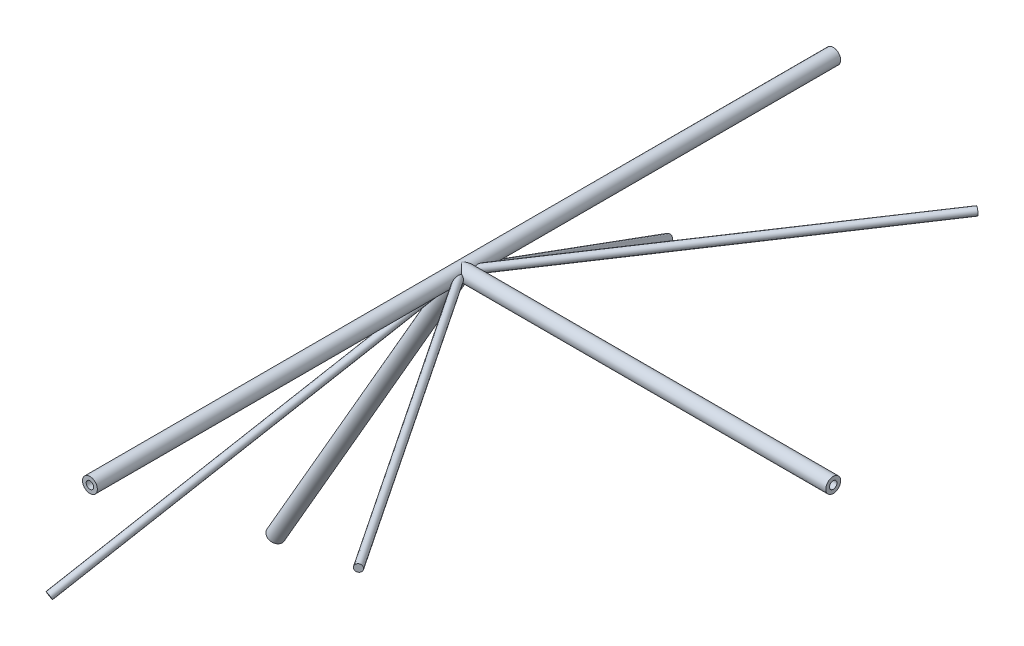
ISO-10303-21;
HEADER;
FILE_DESCRIPTION(('STEP AP214'),'2;1');
FILE_NAME('part.step','',(''),(''),'','','');
FILE_SCHEMA(('AUTOMOTIVE_DESIGN { 1 0 10303 214 1 1 1 1 }'));
ENDSEC;
DATA;
#1=APPLICATION_CONTEXT('core data for automotive mechanical design processes');
#2=APPLICATION_PROTOCOL_DEFINITION('international standard','automotive_design',2000,#1);
#3=PRODUCT_CONTEXT('',#1,'mechanical');
#4=PRODUCT('Part','Part','',(#3));
#5=PRODUCT_RELATED_PRODUCT_CATEGORY('part','',(#4));
#6=PRODUCT_DEFINITION_FORMATION('','',#4);
#7=PRODUCT_DEFINITION_CONTEXT('part definition',#1,'design');
#8=PRODUCT_DEFINITION('design','',#6,#7);
#9=PRODUCT_DEFINITION_SHAPE('','',#8);
#10=(LENGTH_UNIT() NAMED_UNIT(*) SI_UNIT(.MILLI.,.METRE.));
#11=(NAMED_UNIT(*) PLANE_ANGLE_UNIT() SI_UNIT($,.RADIAN.));
#12=(NAMED_UNIT(*) SI_UNIT($,.STERADIAN.) SOLID_ANGLE_UNIT());
#13=UNCERTAINTY_MEASURE_WITH_UNIT(LENGTH_MEASURE(1.E-05),#10,'distance_accuracy_value','');
#14=(GEOMETRIC_REPRESENTATION_CONTEXT(3) GLOBAL_UNCERTAINTY_ASSIGNED_CONTEXT((#13)) GLOBAL_UNIT_ASSIGNED_CONTEXT((#10,
#11,#12)) REPRESENTATION_CONTEXT('',''));
#15=CARTESIAN_POINT('',(0.,0.,0.));
#16=DIRECTION('',(0.,0.,1.));
#17=DIRECTION('',(1.,0.,0.));
#18=AXIS2_PLACEMENT_3D('',#15,#16,#17);
#19=CARTESIAN_POINT('',(0.,0.,-500.));
#20=DIRECTION('',(0.,0.,1.));
#21=DIRECTION('',(1.,0.,0.));
#22=AXIS2_PLACEMENT_3D('',#19,#20,#21);
#23=PLANE('',#22);
#24=CARTESIAN_POINT('',(0.,0.,-500.));
#25=DIRECTION('',(0.,0.,1.));
#26=DIRECTION('',(1.,0.,0.));
#27=AXIS2_PLACEMENT_3D('',#24,#25,#26);
#28=CIRCLE('',#27,5.);
#29=CARTESIAN_POINT('',(5.,0.,-500.));
#30=VERTEX_POINT('',#29);
#31=EDGE_CURVE('E141',#30,#30,#28,.T.);
#32=ORIENTED_EDGE('',*,*,#31,.T.);
#33=EDGE_LOOP('',(#32));
#34=FACE_BOUND('',#33,.T.);
#35=CARTESIAN_POINT('',(0.,0.,-500.));
#36=DIRECTION('',(0.,0.,1.));
#37=DIRECTION('',(1.,0.,0.));
#38=AXIS2_PLACEMENT_3D('',#35,#36,#37);
#39=CIRCLE('',#38,10.);
#40=CARTESIAN_POINT('',(10.,0.,-500.));
#41=VERTEX_POINT('',#40);
#42=EDGE_CURVE('E267',#41,#41,#39,.T.);
#43=ORIENTED_EDGE('',*,*,#42,.F.);
#44=EDGE_LOOP('',(#43));
#45=FACE_BOUND('',#44,.T.);
#46=ADVANCED_FACE('F33',(#34,#45),#23,.F.);
#47=CARTESIAN_POINT('',(0.,0.,500.));
#48=DIRECTION('',(0.,0.,1.));
#49=DIRECTION('',(1.,0.,0.));
#50=AXIS2_PLACEMENT_3D('',#47,#48,#49);
#51=PLANE('',#50);
#52=CARTESIAN_POINT('',(0.,0.,500.));
#53=DIRECTION('',(0.,0.,1.));
#54=DIRECTION('',(1.,0.,0.));
#55=AXIS2_PLACEMENT_3D('',#52,#53,#54);
#56=CIRCLE('',#55,5.);
#57=CARTESIAN_POINT('',(5.,0.,500.));
#58=VERTEX_POINT('',#57);
#59=EDGE_CURVE('E136',#58,#58,#56,.T.);
#60=ORIENTED_EDGE('',*,*,#59,.F.);
#61=EDGE_LOOP('',(#60));
#62=FACE_BOUND('',#61,.T.);
#63=CARTESIAN_POINT('',(0.,0.,500.));
#64=DIRECTION('',(0.,0.,1.));
#65=DIRECTION('',(1.,0.,0.));
#66=AXIS2_PLACEMENT_3D('',#63,#64,#65);
#67=CIRCLE('',#66,10.);
#68=CARTESIAN_POINT('',(10.,0.,500.));
#69=VERTEX_POINT('',#68);
#70=EDGE_CURVE('E271',#69,#69,#67,.T.);
#71=ORIENTED_EDGE('',*,*,#70,.T.);
#72=EDGE_LOOP('',(#71));
#73=FACE_BOUND('',#72,.T.);
#74=ADVANCED_FACE('F259',(#62,#73),#51,.T.);
#75=CARTESIAN_POINT('',(0.,0.,-500.));
#76=DIRECTION('',(0.,0.,1.));
#77=DIRECTION('',(1.,0.,0.));
#78=AXIS2_PLACEMENT_3D('',#75,#76,#77);
#79=CYLINDRICAL_SURFACE('',#78,10.);
#80=CARTESIAN_POINT('',(-3.00640469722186,-9.5373754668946,6.51924191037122));
#81=CARTESIAN_POINT('',(-2.8909768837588,-9.57376040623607,6.58226516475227));
#82=CARTESIAN_POINT('',(-2.7774803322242,-9.60722899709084,6.65056008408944));
#83=CARTESIAN_POINT('',(-2.55547684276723,-9.66865147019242,6.7971238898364));
#84=CARTESIAN_POINT('',(-2.44697279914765,-9.69660218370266,6.87539846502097));
#85=CARTESIAN_POINT('',(-2.23581432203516,-9.74745873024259,7.04133630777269));
#86=CARTESIAN_POINT('',(-2.13317086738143,-9.77035531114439,7.12901636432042));
#87=CARTESIAN_POINT('',(-1.93472973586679,-9.81157985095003,7.31285679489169));
#88=CARTESIAN_POINT('',(-1.83893503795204,-9.82990583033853,7.40902081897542));
#89=CARTESIAN_POINT('',(-1.65552788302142,-9.86244621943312,7.60815413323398));
#90=CARTESIAN_POINT('',(-1.56785996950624,-9.87669013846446,7.71106761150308));
#91=CARTESIAN_POINT('',(-1.40025844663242,-9.90184047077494,7.92341666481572));
#92=CARTESIAN_POINT('',(-1.3203279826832,-9.91274553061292,8.03285486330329));
#93=CARTESIAN_POINT('',(-1.09255032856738,-9.94132217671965,8.36943985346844));
#94=CARTESIAN_POINT('',(-0.956525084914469,-9.95488661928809,8.60506797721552));
#95=CARTESIAN_POINT('',(-0.743169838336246,-9.97277872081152,9.03580469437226));
#96=CARTESIAN_POINT('',(-0.659531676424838,-9.97851006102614,9.22784034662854));
#97=CARTESIAN_POINT('',(-0.509370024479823,-9.98730244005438,9.61864612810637));
#98=CARTESIAN_POINT('',(-0.442855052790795,-9.99036215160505,9.81741955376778));
#99=CARTESIAN_POINT('',(-0.325446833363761,-9.99487520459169,10.2198448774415));
#100=CARTESIAN_POINT('',(-0.274580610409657,-9.99632577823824,10.4235045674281));
#101=CARTESIAN_POINT('',(-0.187016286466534,-9.99834671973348,10.8338970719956));
#102=CARTESIAN_POINT('',(-0.150323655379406,-9.99891674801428,11.0406310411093));
#103=CARTESIAN_POINT('',(-0.0938558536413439,-9.99959313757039,11.4270150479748));
#104=CARTESIAN_POINT('',(-0.072436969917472,-9.9997529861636,11.6064303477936));
#105=CARTESIAN_POINT('',(-0.0381343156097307,-9.99994136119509,11.9660865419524));
#106=CARTESIAN_POINT('',(-0.0252519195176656,-9.9999698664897,12.1463275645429));
#107=CARTESIAN_POINT('',(0.00178628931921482,-10.0000207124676,12.6878251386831));
#108=CARTESIAN_POINT('',(0.00431049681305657,-10.0000083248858,13.0496903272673));
#109=CARTESIAN_POINT('',(-0.0166695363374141,-9.99998783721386,13.7743493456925));
#110=CARTESIAN_POINT('',(-0.0403069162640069,-9.99997975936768,14.1371384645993));
#111=CARTESIAN_POINT('',(-0.110216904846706,-9.99945379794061,14.8603620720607));
#112=CARTESIAN_POINT('',(-0.15648103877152,-9.99893610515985,15.2207973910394));
#113=CARTESIAN_POINT('',(-0.254182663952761,-9.99685339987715,15.8422902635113));
#114=CARTESIAN_POINT('',(-0.300915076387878,-9.99560606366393,16.1041064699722));
#115=CARTESIAN_POINT('',(-0.404706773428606,-9.99194250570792,16.6257039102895));
#116=CARTESIAN_POINT('',(-0.461766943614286,-9.9895261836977,16.8854849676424));
#117=CARTESIAN_POINT('',(-0.585996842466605,-9.98300973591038,17.4029793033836));
#118=CARTESIAN_POINT('',(-0.6531805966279,-9.97890726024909,17.6606891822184));
#119=CARTESIAN_POINT('',(-0.797568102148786,-9.96840654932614,18.1732264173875));
#120=CARTESIAN_POINT('',(-0.874771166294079,-9.96200847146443,18.4280539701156));
#121=CARTESIAN_POINT('',(-1.038987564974,-9.94621916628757,18.9328343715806));
#122=CARTESIAN_POINT('',(-1.12594235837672,-9.93684524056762,19.1828067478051));
#123=CARTESIAN_POINT('',(-1.3106095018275,-9.91418030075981,19.6786513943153));
#124=CARTESIAN_POINT('',(-1.40832416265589,-9.90088844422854,19.9245227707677));
#125=CARTESIAN_POINT('',(-1.61522845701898,-9.86924381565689,20.410423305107));
#126=CARTESIAN_POINT('',(-1.72439158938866,-9.85090257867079,20.6504644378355));
#127=CARTESIAN_POINT('',(-1.95580164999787,-9.80758611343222,21.123474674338));
#128=CARTESIAN_POINT('',(-2.07804072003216,-9.78261485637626,21.3564479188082));
#129=CARTESIAN_POINT('',(-2.28171342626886,-9.73650177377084,21.7140000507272));
#130=CARTESIAN_POINT('',(-2.35796117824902,-9.71836616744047,21.8419253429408));
#131=CARTESIAN_POINT('',(-2.51598745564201,-9.67866001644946,22.0938331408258));
#132=CARTESIAN_POINT('',(-2.59776717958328,-9.6570887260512,22.2178147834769));
#133=CARTESIAN_POINT('',(-2.76731740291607,-9.60987438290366,22.4604333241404));
#134=CARTESIAN_POINT('',(-2.85507441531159,-9.58424033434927,22.5790813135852));
#135=CARTESIAN_POINT('',(-3.03747678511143,-9.52800287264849,22.8096656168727));
#136=CARTESIAN_POINT('',(-3.13211817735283,-9.49740230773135,22.9216057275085));
#137=CARTESIAN_POINT('',(-3.34115919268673,-9.42604469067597,23.1495779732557));
#138=CARTESIAN_POINT('',(-3.45656352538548,-9.38450638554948,23.2644634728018));
#139=CARTESIAN_POINT('',(-3.69831404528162,-9.29188852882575,23.4779872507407));
#140=CARTESIAN_POINT('',(-3.82465095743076,-9.24081702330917,23.5766390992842));
#141=CARTESIAN_POINT('',(-4.05814430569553,-9.14022321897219,23.7301961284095));
#142=CARTESIAN_POINT('',(-4.16306621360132,-9.09302530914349,23.7899458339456));
#143=CARTESIAN_POINT('',(-4.37831589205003,-8.99135446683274,23.890621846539));
#144=CARTESIAN_POINT('',(-4.48863555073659,-8.93689225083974,23.9315754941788));
#145=CARTESIAN_POINT('',(-4.71332313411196,-8.82047120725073,23.9905247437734));
#146=CARTESIAN_POINT('',(-4.82772271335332,-8.75843463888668,24.0082557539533));
#147=CARTESIAN_POINT('',(-5.05474840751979,-8.62939917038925,24.0172674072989));
#148=CARTESIAN_POINT('',(-5.16737528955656,-8.56240249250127,24.0085598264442));
#149=CARTESIAN_POINT('',(-5.36890621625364,-8.43721983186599,23.9694775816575));
#150=CARTESIAN_POINT('',(-5.45873945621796,-8.37932194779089,23.9427588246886));
#151=CARTESIAN_POINT('',(-5.63237408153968,-8.26361050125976,23.8740841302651));
#152=CARTESIAN_POINT('',(-5.7161723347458,-8.20579699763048,23.8321203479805));
#153=CARTESIAN_POINT('',(-5.9244660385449,-8.05762640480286,23.7074986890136));
#154=CARTESIAN_POINT('',(-6.04390100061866,-7.9681332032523,23.6154240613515));
#155=CARTESIAN_POINT('',(-6.26704368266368,-7.79386672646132,23.4101427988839));
#156=CARTESIAN_POINT('',(-6.37070043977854,-7.70910928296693,23.2968702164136));
#157=CARTESIAN_POINT('',(-6.55769080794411,-7.55053639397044,23.0646203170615));
#158=CARTESIAN_POINT('',(-6.64194017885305,-7.47637049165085,22.9466013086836));
#159=CARTESIAN_POINT('',(-6.80072194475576,-7.3322362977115,22.7017083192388));
#160=CARTESIAN_POINT('',(-6.87524533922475,-7.26227192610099,22.5748263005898));
#161=CARTESIAN_POINT('',(-7.01622782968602,-7.12615999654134,22.3143490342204));
#162=CARTESIAN_POINT('',(-7.08267008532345,-7.06002055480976,22.1807405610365));
#163=CARTESIAN_POINT('',(-7.2085617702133,-6.93143012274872,21.9086439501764));
#164=CARTESIAN_POINT('',(-7.2680133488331,-6.86897800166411,21.7701573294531));
#165=CARTESIAN_POINT('',(-7.38878974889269,-6.73904375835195,21.4698417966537));
#166=CARTESIAN_POINT('',(-7.4492293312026,-6.67206654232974,21.3074408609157));
#167=CARTESIAN_POINT('',(-7.56352873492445,-6.54220964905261,20.9787136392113));
#168=CARTESIAN_POINT('',(-7.61738710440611,-6.47933087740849,20.8123864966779));
#169=CARTESIAN_POINT('',(-7.71943918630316,-6.35740388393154,20.4764436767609));
#170=CARTESIAN_POINT('',(-7.76762764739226,-6.29835923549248,20.3068251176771));
#171=CARTESIAN_POINT('',(-7.85896934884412,-6.18400697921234,19.964984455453));
#172=CARTESIAN_POINT('',(-7.90212200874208,-6.12869980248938,19.7927620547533));
#173=CARTESIAN_POINT('',(-8.02507158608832,-5.96795961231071,19.2719505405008));
#174=CARTESIAN_POINT('',(-8.09811333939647,-5.86800856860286,18.920052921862));
#175=CARTESIAN_POINT('',(-8.22930233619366,-5.68255407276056,18.2097242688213));
#176=CARTESIAN_POINT('',(-8.28744675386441,-5.59705336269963,17.8512920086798));
#177=CARTESIAN_POINT('',(-8.36917387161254,-5.47356247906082,17.2795086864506));
#178=CARTESIAN_POINT('',(-8.39707261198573,-5.43060329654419,17.0678259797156));
#179=CARTESIAN_POINT('',(-8.44861340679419,-5.35006748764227,16.6429576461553));
#180=CARTESIAN_POINT('',(-8.47225622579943,-5.31248989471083,16.429772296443));
#181=CARTESIAN_POINT('',(-8.5154364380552,-5.24299673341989,16.0019340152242));
#182=CARTESIAN_POINT('',(-8.53497136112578,-5.21108457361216,15.7872802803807));
#183=CARTESIAN_POINT('',(-8.56995441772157,-5.15335048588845,15.356811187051));
#184=CARTESIAN_POINT('',(-8.58540239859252,-5.12752878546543,15.1409957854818));
#185=CARTESIAN_POINT('',(-8.61209202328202,-5.08257335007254,14.7093400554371));
#186=CARTESIAN_POINT('',(-8.62335135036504,-5.06341152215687,14.4935037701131));
#187=CARTESIAN_POINT('',(-8.64158788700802,-5.03222481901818,14.0611379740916));
#188=CARTESIAN_POINT('',(-8.64856531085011,-5.02019958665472,13.8446084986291));
#189=CARTESIAN_POINT('',(-8.65794377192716,-5.0040082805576,13.4113128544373));
#190=CARTESIAN_POINT('',(-8.66034832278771,-4.9998361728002,13.1945469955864));
#191=CARTESIAN_POINT('',(-8.66015409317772,-5.0001736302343,12.7610472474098));
#192=CARTESIAN_POINT('',(-8.65755627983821,-5.00468151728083,12.5443133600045));
#193=CARTESIAN_POINT('',(-8.64729148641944,-5.02239409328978,12.1334245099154));
#194=CARTESIAN_POINT('',(-8.64016742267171,-5.03466681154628,11.9392168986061));
#195=CARTESIAN_POINT('',(-8.6207894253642,-5.06777688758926,11.5517832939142));
#196=CARTESIAN_POINT('',(-8.60853584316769,-5.08861365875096,11.3585572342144));
#197=CARTESIAN_POINT('',(-8.57812397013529,-5.13971584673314,10.9735943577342));
#198=CARTESIAN_POINT('',(-8.55995957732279,-5.16999100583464,10.7818592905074));
#199=CARTESIAN_POINT('',(-8.51677999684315,-5.24081902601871,10.4010418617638));
#200=CARTESIAN_POINT('',(-8.49176469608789,-5.28137205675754,10.2119595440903));
#201=CARTESIAN_POINT('',(-8.4333494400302,-5.37416698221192,9.83522802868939));
#202=CARTESIAN_POINT('',(-8.39984230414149,-5.42655728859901,9.64763141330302));
#203=CARTESIAN_POINT('',(-8.32321963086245,-5.5433652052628,9.2781537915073));
#204=CARTESIAN_POINT('',(-8.2801031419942,-5.60778400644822,9.09627335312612));
#205=CARTESIAN_POINT('',(-8.18285829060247,-5.74875159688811,8.74083673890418));
#206=CARTESIAN_POINT('',(-8.12875825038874,-5.82526907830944,8.56726054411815));
#207=CARTESIAN_POINT('',(-8.00794311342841,-5.9902659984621,8.23050638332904));
#208=CARTESIAN_POINT('',(-7.94123508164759,-6.07873873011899,8.06732266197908));
#209=CARTESIAN_POINT('',(-7.81763896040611,-6.2362680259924,7.80467213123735));
#210=CARTESIAN_POINT('',(-7.76452917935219,-6.3023764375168,7.70163773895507));
#211=CARTESIAN_POINT('',(-7.6515636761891,-6.43905523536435,7.50247164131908));
#212=CARTESIAN_POINT('',(-7.59170972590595,-6.50962444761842,7.40633813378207));
#213=CARTESIAN_POINT('',(-7.46502044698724,-6.65452674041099,7.22181921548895));
#214=CARTESIAN_POINT('',(-7.3981855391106,-6.72885959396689,7.13343333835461));
#215=CARTESIAN_POINT('',(-7.25742815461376,-6.88043823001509,6.96519173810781));
#216=CARTESIAN_POINT('',(-7.18350542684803,-6.95768411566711,6.88533631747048));
#217=CARTESIAN_POINT('',(-7.028276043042,-7.11446098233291,6.73452604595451));
#218=CARTESIAN_POINT('',(-6.94693773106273,-7.19400066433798,6.66361275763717));
#219=CARTESIAN_POINT('',(-6.77736880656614,-7.35396861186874,6.53170781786));
#220=CARTESIAN_POINT('',(-6.68913809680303,-7.434396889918,6.47071630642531));
#221=CARTESIAN_POINT('',(-6.50615174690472,-7.59505173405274,6.35913753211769));
#222=CARTESIAN_POINT('',(-6.41139615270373,-7.6752783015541,6.30855019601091));
#223=CARTESIAN_POINT('',(-6.21587436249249,-7.83446184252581,6.218146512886));
#224=CARTESIAN_POINT('',(-6.11510855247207,-7.9134188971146,6.17832947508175));
#225=CARTESIAN_POINT('',(-5.9159556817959,-8.06323864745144,6.11229093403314));
#226=CARTESIAN_POINT('',(-5.81795410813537,-8.13426514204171,6.08527548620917));
#227=CARTESIAN_POINT('',(-5.61796327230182,-8.27365348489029,6.04082241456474));
#228=CARTESIAN_POINT('',(-5.51597408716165,-8.34201538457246,6.02338460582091));
#229=CARTESIAN_POINT('',(-5.30867674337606,-8.47544382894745,5.99816928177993));
#230=CARTESIAN_POINT('',(-5.2033680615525,-8.54050984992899,5.9903932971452));
#231=CARTESIAN_POINT('',(-4.99020411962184,-8.6667876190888,5.98454252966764));
#232=CARTESIAN_POINT('',(-4.88234893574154,-8.72799948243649,5.98646745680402));
#233=CARTESIAN_POINT('',(-4.66752626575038,-8.84470356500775,5.99984565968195));
#234=CARTESIAN_POINT('',(-4.56059984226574,-8.90029795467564,6.01106860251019));
#235=CARTESIAN_POINT('',(-4.34590937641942,-9.00707744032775,6.04269471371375));
#236=CARTESIAN_POINT('',(-4.23814535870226,-9.05826266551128,6.06309761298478));
#237=CARTESIAN_POINT('',(-4.02279942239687,-9.15592936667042,6.11294665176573));
#238=CARTESIAN_POINT('',(-3.91521749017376,-9.20241828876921,6.14237816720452));
#239=CARTESIAN_POINT('',(-3.70096480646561,-9.29065520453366,6.21013688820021));
#240=CARTESIAN_POINT('',(-3.5942936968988,-9.33240514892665,6.2484604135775));
#241=CARTESIAN_POINT('',(-3.40684484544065,-9.40218099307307,6.32405718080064));
#242=CARTESIAN_POINT('',(-3.32571031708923,-9.43116524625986,6.35957644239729));
#243=CARTESIAN_POINT('',(-3.16488557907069,-9.4863442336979,6.43565938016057));
#244=CARTESIAN_POINT('',(-3.08519521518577,-9.5125392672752,6.47622251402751));
#245=CARTESIAN_POINT('',(-3.00640469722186,-9.5373754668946,6.51924191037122));
#246=B_SPLINE_CURVE_WITH_KNOTS('',3,(#80,#81,#82,#83,#84,#85,#86,#87,#88,#89,#90,#91,#92,#93,
#94,#95,#96,#97,#98,#99,#100,#101,#102,#103,#104,#105,#106,#107,#108,#109,#110,#111,#112,#113,
#114,#115,#116,#117,#118,#119,#120,#121,#122,#123,#124,#125,#126,#127,#128,#129,#130,#131,#132,
#133,#134,#135,#136,#137,#138,#139,#140,#141,#142,#143,#144,#145,#146,#147,#148,#149,#150,#151,
#152,#153,#154,#155,#156,#157,#158,#159,#160,#161,#162,#163,#164,#165,#166,#167,#168,#169,#170,
#171,#172,#173,#174,#175,#176,#177,#178,#179,#180,#181,#182,#183,#184,#185,#186,#187,#188,#189,
#190,#191,#192,#193,#194,#195,#196,#197,#198,#199,#200,#201,#202,#203,#204,#205,#206,#207,#208,
#209,#210,#211,#212,#213,#214,#215,#216,#217,#218,#219,#220,#221,#222,#223,#224,#225,#226,#227,
#228,#229,#230,#231,#232,#233,#234,#235,#236,#237,#238,#239,#240,#241,#242,#243,#244,#245),
.UNSPECIFIED.,.T.,.F.,(4,2,2,2,2,2,2,2,2,2,2,2,2,2,2,2,2,2,2,2,2,2,2,2,2,2,2,2,2,2,2,2,2,2,2,2,
2,2,2,2,2,2,2,2,2,2,2,2,2,2,2,2,2,2,2,2,2,2,2,2,2,2,2,2,2,2,2,2,2,2,2,2,2,2,2,2,2,2,2,2,2,2,4),
(0.,0.4092582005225,0.818750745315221,1.2289868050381,1.63940022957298,2.04676727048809,
2.45429922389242,3.26851149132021,3.89632546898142,4.52445116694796,5.15365560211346,
5.78310261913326,6.32495103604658,6.86688667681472,7.95125837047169,9.04117403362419,
10.1306817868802,10.9283562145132,11.7260990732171,12.5249574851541,13.3237611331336,
14.1180030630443,14.9124158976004,15.7050287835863,16.497167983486,16.9470897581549,
17.3971093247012,17.8461451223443,18.2949243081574,18.7980614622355,19.3007758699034,
19.6883475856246,20.0753537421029,20.4667320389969,20.8579360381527,21.1870874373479,
21.5164084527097,22.0394709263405,22.5641885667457,23.0520801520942,23.5404200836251,
24.0297608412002,24.5189507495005,25.0760363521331,25.633244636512,26.1909649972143,
26.748749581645,27.8670784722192,28.9856193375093,29.6388962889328,30.2920557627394,
30.945606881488,31.5991824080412,32.249966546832,32.9007181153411,33.5509694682,
34.2010951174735,34.7850433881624,35.3689516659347,35.9534646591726,36.5379873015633,
37.13029088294,37.7226531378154,38.3135068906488,38.9040305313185,39.3039825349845,
39.7038297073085,40.1036527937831,40.5034900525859,40.9051221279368,41.3067598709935,
41.7083947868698,42.1100039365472,42.4815844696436,42.8531578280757,43.2247900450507,
43.5964111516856,43.9590923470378,44.321762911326,44.6838491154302,45.0457857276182,
45.3251735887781,45.6045314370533),.UNSPECIFIED.);
#247=CARTESIAN_POINT('',(-0.756949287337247,-9.97131023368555,9.01388261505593));
#248=VERTEX_POINT('',#247);
#249=CARTESIAN_POINT('',(-8.25693332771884,-5.64119242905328,9.01388261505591));
#250=VERTEX_POINT('',#249);
#251=EDGE_CURVE('E163',#248,#250,#246,.T.);
#252=ORIENTED_EDGE('',*,*,#251,.F.);
#253=CARTESIAN_POINT('',(0.,0.,0.));
#254=DIRECTION('',(0.353553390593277,0.612372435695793,0.707106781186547));
#255=DIRECTION('',(-0.353553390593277,-0.612372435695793,0.707106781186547));
#256=AXIS2_PLACEMENT_3D('',#253,#254,#255);
#257=ELLIPSE('',#256,14.142135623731,10.);
#258=CARTESIAN_POINT('',(5.00000000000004,-8.66025403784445,4.99999999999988));
#259=VERTEX_POINT('',#258);
#260=EDGE_CURVE('E280',#259,#248,#257,.F.);
#261=ORIENTED_EDGE('',*,*,#260,.F.);
#262=CARTESIAN_POINT('',(0.,0.,0.));
#263=DIRECTION('',(-0.707106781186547,0.,0.707106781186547));
#264=DIRECTION('',(0.707106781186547,0.,0.707106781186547));
#265=AXIS2_PLACEMENT_3D('',#262,#263,#264);
#266=ELLIPSE('',#265,14.1421356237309,10.);
#267=CARTESIAN_POINT('',(9.01388261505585,-4.33011780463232,9.01388261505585));
#268=VERTEX_POINT('',#267);
#269=EDGE_CURVE('E295',#268,#259,#266,.F.);
#270=ORIENTED_EDGE('',*,*,#269,.F.);
#271=CARTESIAN_POINT('',(10.,0.,5.98614417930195));
#272=CARTESIAN_POINT('',(9.99999989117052,0.122217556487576,5.98614425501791));
#273=CARTESIAN_POINT('',(9.99775464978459,0.244437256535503,5.99086368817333));
#274=CARTESIAN_POINT('',(9.9888281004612,0.488031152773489,6.00972422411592));
#275=CARTESIAN_POINT('',(9.98214506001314,0.609405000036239,6.02386900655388));
#276=CARTESIAN_POINT('',(9.96451245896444,0.850339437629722,6.06151258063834));
#277=CARTESIAN_POINT('',(9.95356424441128,0.969900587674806,6.08500842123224));
#278=CARTESIAN_POINT('',(9.92767248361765,1.20643260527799,6.14124978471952));
#279=CARTESIAN_POINT('',(9.91272743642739,1.3234024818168,6.17399878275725));
#280=CARTESIAN_POINT('',(9.87924172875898,1.55374134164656,6.2485248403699));
#281=CARTESIAN_POINT('',(9.86070539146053,1.66711446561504,6.29029105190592));
#282=CARTESIAN_POINT('',(9.82048476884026,1.88967536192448,6.38265110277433));
#283=CARTESIAN_POINT('',(9.79879932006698,1.99886156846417,6.43324820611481));
#284=CARTESIAN_POINT('',(9.75283924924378,2.21224628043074,6.54291456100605));
#285=CARTESIAN_POINT('',(9.72856597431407,2.31644734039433,6.60197941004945));
#286=CARTESIAN_POINT('',(9.67800787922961,2.51934538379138,6.72822237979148));
#287=CARTESIAN_POINT('',(9.65172233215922,2.61804035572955,6.7954034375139));
#288=CARTESIAN_POINT('',(9.59737213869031,2.81080521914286,6.93844293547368));
#289=CARTESIAN_POINT('',(9.56928689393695,2.90478485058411,7.01441525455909));
#290=CARTESIAN_POINT('',(9.51234814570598,3.08614197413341,7.17362657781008));
#291=CARTESIAN_POINT('',(9.48349434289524,3.17351684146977,7.25686844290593));
#292=CARTESIAN_POINT('',(9.3967546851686,3.42527730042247,7.51655877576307));
#293=CARTESIAN_POINT('',(9.33865328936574,3.57942587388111,7.70306725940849));
#294=CARTESIAN_POINT('',(9.2445776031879,3.81421289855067,8.03302982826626));
#295=CARTESIAN_POINT('',(9.20752352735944,3.90250345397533,8.17090406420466));
#296=CARTESIAN_POINT('',(9.13615860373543,4.06677040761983,8.45455118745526));
#297=CARTESIAN_POINT('',(9.1018485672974,4.14274317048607,8.60032638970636));
#298=CARTESIAN_POINT('',(9.0366675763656,4.28306433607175,8.89829080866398));
#299=CARTESIAN_POINT('',(9.00580097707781,4.34739808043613,9.05048781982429));
#300=CARTESIAN_POINT('',(8.94796991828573,4.46521280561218,9.35976798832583));
#301=CARTESIAN_POINT('',(8.92100679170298,4.518690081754,9.51685279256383));
#302=CARTESIAN_POINT('',(8.8583716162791,4.64070648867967,9.91659099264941));
#303=CARTESIAN_POINT('',(8.82536935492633,4.70281143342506,10.161635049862));
#304=CARTESIAN_POINT('',(8.76882315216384,4.80741411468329,10.656944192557));
#305=CARTESIAN_POINT('',(8.74528459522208,4.84990069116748,10.9072121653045));
#306=CARTESIAN_POINT('',(8.70707356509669,4.91816946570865,11.4112532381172));
#307=CARTESIAN_POINT('',(8.69242299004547,4.94391041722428,11.6650334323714));
#308=CARTESIAN_POINT('',(8.67127802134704,4.98090127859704,12.1740298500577));
#309=CARTESIAN_POINT('',(8.66478670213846,4.99214572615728,12.4292465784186));
#310=CARTESIAN_POINT('',(8.65934676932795,5.0015724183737,12.9177134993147));
#311=CARTESIAN_POINT('',(8.65979025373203,5.00080738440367,13.1509401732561));
#312=CARTESIAN_POINT('',(8.66610811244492,4.98985054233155,13.6170457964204));
#313=CARTESIAN_POINT('',(8.6719816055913,4.97966026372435,13.8499247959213));
#314=CARTESIAN_POINT('',(8.68856001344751,4.95067682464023,14.3151794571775));
#315=CARTESIAN_POINT('',(8.69926942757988,4.93187565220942,14.5475544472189));
#316=CARTESIAN_POINT('',(8.72496555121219,4.88627261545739,15.0112800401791));
#317=CARTESIAN_POINT('',(8.73995240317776,4.85947048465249,15.2426306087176));
#318=CARTESIAN_POINT('',(8.77370701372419,4.79825874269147,15.7041358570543));
#319=CARTESIAN_POINT('',(8.79247629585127,4.76384606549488,15.9342900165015));
#320=CARTESIAN_POINT('',(8.83333741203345,4.68764541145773,16.3930782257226));
#321=CARTESIAN_POINT('',(8.8554293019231,4.64585731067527,16.621712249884));
#322=CARTESIAN_POINT('',(8.90250817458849,4.55499355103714,17.0770813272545));
#323=CARTESIAN_POINT('',(8.92749339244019,4.50592232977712,17.3038174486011));
#324=CARTESIAN_POINT('',(8.97998896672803,4.40037182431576,17.7552482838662));
#325=CARTESIAN_POINT('',(9.0074991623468,4.34389301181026,17.9799431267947));
#326=CARTESIAN_POINT('',(9.0688571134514,4.21446202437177,18.4595506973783));
#327=CARTESIAN_POINT('',(9.10304431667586,4.14030864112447,18.7140976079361));
#328=CARTESIAN_POINT('',(9.17375571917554,3.98118016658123,19.219490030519));
#329=CARTESIAN_POINT('',(9.21028006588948,3.89620439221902,19.4703353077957));
#330=CARTESIAN_POINT('',(9.28509202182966,3.71439422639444,19.9670891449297));
#331=CARTESIAN_POINT('',(9.32337741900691,3.61757447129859,20.213003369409));
#332=CARTESIAN_POINT('',(9.4011694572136,3.41032309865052,20.6988141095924));
#333=CARTESIAN_POINT('',(9.44067570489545,3.29989583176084,20.9387125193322));
#334=CARTESIAN_POINT('',(9.50503353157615,3.10810001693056,21.3204118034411));
#335=CARTESIAN_POINT('',(9.5297294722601,3.03170516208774,21.4647403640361));
#336=CARTESIAN_POINT('',(9.57909278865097,2.8719303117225,21.7494694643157));
#337=CARTESIAN_POINT('',(9.60376016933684,2.78855181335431,21.8898708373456));
#338=CARTESIAN_POINT('',(9.6527682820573,2.6138654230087,22.1655575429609));
#339=CARTESIAN_POINT('',(9.67710930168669,2.52256512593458,22.3008476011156));
#340=CARTESIAN_POINT('',(9.72509468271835,2.33073072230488,22.564791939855));
#341=CARTESIAN_POINT('',(9.74873941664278,2.23020167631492,22.6934497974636));
#342=CARTESIAN_POINT('',(9.79738270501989,2.00645562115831,22.9557320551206));
#343=CARTESIAN_POINT('',(9.82223773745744,1.88195867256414,23.0883075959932));
#344=CARTESIAN_POINT('',(9.86930667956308,1.61705240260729,23.3372756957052));
#345=CARTESIAN_POINT('',(9.89152319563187,1.47665905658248,23.4536842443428));
#346=CARTESIAN_POINT('',(9.92652846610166,1.21522991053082,23.6359466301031));
#347=CARTESIAN_POINT('',(9.94028602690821,1.0981172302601,23.7071654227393));
#348=CARTESIAN_POINT('',(9.96422499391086,0.853917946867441,23.8306606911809));
#349=CARTESIAN_POINT('',(9.97441313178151,0.726850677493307,23.8829728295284));
#350=CARTESIAN_POINT('',(9.98859057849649,0.489326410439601,23.9556328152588));
#351=CARTESIAN_POINT('',(9.99338244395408,0.380202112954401,23.9801268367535));
#352=CARTESIAN_POINT('',(9.9993396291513,0.159301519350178,24.0105657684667));
#353=CARTESIAN_POINT('',(10.0005077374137,0.0475273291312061,24.0165249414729));
#354=CARTESIAN_POINT('',(9.99908352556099,-0.175391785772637,24.0092530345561));
#355=CARTESIAN_POINT('',(9.99648991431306,-0.286536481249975,23.9960153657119));
#356=CARTESIAN_POINT('',(9.98783745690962,-0.50508186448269,23.9517652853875));
#357=CARTESIAN_POINT('',(9.98177541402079,-0.612479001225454,23.9207364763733));
#358=CARTESIAN_POINT('',(9.96409756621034,-0.85841404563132,23.8299804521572));
#359=CARTESIAN_POINT('',(9.95127568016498,-0.994527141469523,23.763983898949));
#360=CARTESIAN_POINT('',(9.92187135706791,-1.2544787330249,23.6117600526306));
#361=CARTESIAN_POINT('',(9.90527956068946,-1.3782855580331,23.5254823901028));
#362=CARTESIAN_POINT('',(9.8721485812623,-1.59721968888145,23.3520042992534));
#363=CARTESIAN_POINT('',(9.85593825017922,-1.69392057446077,23.2666842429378));
#364=CARTESIAN_POINT('',(9.82223456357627,-1.87952520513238,23.088110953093));
#365=CARTESIAN_POINT('',(9.80474021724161,-1.96842281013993,22.9948515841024));
#366=CARTESIAN_POINT('',(9.7688667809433,-2.13936358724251,22.8022013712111));
#367=CARTESIAN_POINT('',(9.75048635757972,-2.22139588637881,22.7028012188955));
#368=CARTESIAN_POINT('',(9.71315969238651,-2.37930867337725,22.4992984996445));
#369=CARTESIAN_POINT('',(9.6942132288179,-2.45518670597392,22.3951940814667));
#370=CARTESIAN_POINT('',(9.65430213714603,-2.60791491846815,22.1739482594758));
#371=CARTESIAN_POINT('',(9.63330677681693,-2.68426168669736,22.0564663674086));
#372=CARTESIAN_POINT('',(9.59113637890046,-2.83124240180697,21.8179994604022));
#373=CARTESIAN_POINT('',(9.56996129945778,-2.90187497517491,21.6970136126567));
#374=CARTESIAN_POINT('',(9.50639710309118,-3.10626507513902,21.3296301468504));
#375=CARTESIAN_POINT('',(9.4640003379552,-3.2323992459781,21.0789792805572));
#376=CARTESIAN_POINT('',(9.38005740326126,-3.4684579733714,20.5689132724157));
#377=CARTESIAN_POINT('',(9.3385153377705,-3.57831533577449,20.3094669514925));
#378=CARTESIAN_POINT('',(9.25722129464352,-3.78365309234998,19.7848298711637));
#379=CARTESIAN_POINT('',(9.21746857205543,-3.87913950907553,19.5196415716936));
#380=CARTESIAN_POINT('',(9.14158510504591,-4.05465897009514,18.9930117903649));
#381=CARTESIAN_POINT('',(9.1053802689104,-4.13507941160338,18.7317091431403));
#382=CARTESIAN_POINT('',(9.03580739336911,-4.28497463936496,18.205576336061));
#383=CARTESIAN_POINT('',(9.00243977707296,-4.35444779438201,17.9407456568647));
#384=CARTESIAN_POINT('',(8.93908829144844,-4.4830615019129,17.4078552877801));
#385=CARTESIAN_POINT('',(8.90910846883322,-4.54218974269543,17.1397921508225));
#386=CARTESIAN_POINT('',(8.85320163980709,-4.65021688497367,16.6012106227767));
#387=CARTESIAN_POINT('',(8.82727436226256,-4.69911647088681,16.3306923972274));
#388=CARTESIAN_POINT('',(8.78025819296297,-4.78638812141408,15.7887405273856));
#389=CARTESIAN_POINT('',(8.75914899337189,-4.82480451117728,15.517315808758));
#390=CARTESIAN_POINT('',(8.7223861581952,-4.89095221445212,14.9727577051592));
#391=CARTESIAN_POINT('',(8.70673309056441,-4.91868241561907,14.6996241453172));
#392=CARTESIAN_POINT('',(8.68176188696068,-4.96262531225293,14.1525240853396));
#393=CARTESIAN_POINT('',(8.67243465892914,-4.97885453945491,13.878559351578));
#394=CARTESIAN_POINT('',(8.66103765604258,-4.99865705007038,13.3300648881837));
#395=CARTESIAN_POINT('',(8.65896561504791,-5.00223428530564,13.0555353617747));
#396=CARTESIAN_POINT('',(8.6625790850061,-4.99597048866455,12.5777403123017));
#397=CARTESIAN_POINT('',(8.66639583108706,-4.98936232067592,12.3744177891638));
#398=CARTESIAN_POINT('',(8.6790262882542,-4.96736061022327,11.9683915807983));
#399=CARTESIAN_POINT('',(8.6878397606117,-4.95196748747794,11.7656878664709));
#400=CARTESIAN_POINT('',(8.71089646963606,-4.91129655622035,11.3614388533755));
#401=CARTESIAN_POINT('',(8.72514293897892,-4.88601286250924,11.1598943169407));
#402=CARTESIAN_POINT('',(8.7594372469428,-4.82426291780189,10.7589883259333));
#403=CARTESIAN_POINT('',(8.77948516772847,-4.78779650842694,10.5596269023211));
#404=CARTESIAN_POINT('',(8.82594384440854,-4.70161179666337,10.1616430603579));
#405=CARTESIAN_POINT('',(8.85243680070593,-4.65172133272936,9.96306690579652));
#406=CARTESIAN_POINT('',(8.91167260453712,-4.53720771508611,9.57107529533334));
#407=CARTESIAN_POINT('',(8.9444161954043,-4.47258280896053,9.37766045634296));
#408=CARTESIAN_POINT('',(9.01571485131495,-4.32705882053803,8.99868301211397));
#409=CARTESIAN_POINT('',(9.05425488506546,-4.24620165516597,8.8131016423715));
#410=CARTESIAN_POINT('',(9.13633680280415,-4.0665821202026,8.45199534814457));
#411=CARTESIAN_POINT('',(9.17987558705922,-3.96783082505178,8.27646429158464));
#412=CARTESIAN_POINT('',(9.2549848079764,-3.7882988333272,7.99611898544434));
#413=CARTESIAN_POINT('',(9.28557618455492,-3.71286618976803,7.8875944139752));
#414=CARTESIAN_POINT('',(9.34766572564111,-3.55365264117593,7.6771437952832));
#415=CARTESIAN_POINT('',(9.37916363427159,-3.46987407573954,7.57521591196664));
#416=CARTESIAN_POINT('',(9.44237001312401,-3.29399102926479,7.37884568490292));
#417=CARTESIAN_POINT('',(9.47407851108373,-3.20188543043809,7.28440434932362));
#418=CARTESIAN_POINT('',(9.53688896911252,-3.00964541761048,7.10393578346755));
#419=CARTESIAN_POINT('',(9.56799119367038,-2.90951460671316,7.01790481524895));
#420=CARTESIAN_POINT('',(9.62892091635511,-2.70106163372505,6.85455292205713));
#421=CARTESIAN_POINT('',(9.65874038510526,-2.59269710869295,6.7772829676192));
#422=CARTESIAN_POINT('',(9.71604584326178,-2.36892143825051,6.63270315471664));
#423=CARTESIAN_POINT('',(9.74353177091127,-2.25351010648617,6.56539355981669));
#424=CARTESIAN_POINT('',(9.79532875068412,-2.0164933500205,6.44131820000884));
#425=CARTESIAN_POINT('',(9.8196402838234,-1.89488886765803,6.38455083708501));
#426=CARTESIAN_POINT('',(9.86433634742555,-1.64644760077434,6.28199523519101));
#427=CARTESIAN_POINT('',(9.88472133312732,-1.51961142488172,6.23620572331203));
#428=CARTESIAN_POINT('',(9.91850884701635,-1.2790265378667,6.16129270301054));
#429=CARTESIAN_POINT('',(9.9324804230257,-1.16579380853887,6.1307597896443));
#430=CARTESIAN_POINT('',(9.95667752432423,-0.936917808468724,6.07831045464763));
#431=CARTESIAN_POINT('',(9.96690199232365,-0.821273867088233,6.05639646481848));
#432=CARTESIAN_POINT('',(9.98335328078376,-0.588447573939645,6.02130798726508));
#433=CARTESIAN_POINT('',(9.98958212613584,-0.471266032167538,6.00812907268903));
#434=CARTESIAN_POINT('',(9.99790630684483,-0.236057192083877,5.99054550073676));
#435=CARTESIAN_POINT('',(10.0000001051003,-0.118029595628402,5.98614410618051));
#436=CARTESIAN_POINT('',(10.,0.,5.98614417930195));
#437=B_SPLINE_CURVE_WITH_KNOTS('',3,(#271,#272,#273,#274,#275,#276,#277,#278,#279,#280,#281,
#282,#283,#284,#285,#286,#287,#288,#289,#290,#291,#292,#293,#294,#295,#296,#297,#298,#299,#300,
#301,#302,#303,#304,#305,#306,#307,#308,#309,#310,#311,#312,#313,#314,#315,#316,#317,#318,#319,
#320,#321,#322,#323,#324,#325,#326,#327,#328,#329,#330,#331,#332,#333,#334,#335,#336,#337,#338,
#339,#340,#341,#342,#343,#344,#345,#346,#347,#348,#349,#350,#351,#352,#353,#354,#355,#356,#357,
#358,#359,#360,#361,#362,#363,#364,#365,#366,#367,#368,#369,#370,#371,#372,#373,#374,#375,#376,
#377,#378,#379,#380,#381,#382,#383,#384,#385,#386,#387,#388,#389,#390,#391,#392,#393,#394,#395,
#396,#397,#398,#399,#400,#401,#402,#403,#404,#405,#406,#407,#408,#409,#410,#411,#412,#413,#414,
#415,#416,#417,#418,#419,#420,#421,#422,#423,#424,#425,#426,#427,#428,#429,#430,#431,#432,#433,
#434,#435,#436),.UNSPECIFIED.,.T.,.F.,(4,2,2,2,2,2,2,2,2,2,2,2,2,2,2,2,2,2,2,2,2,2,2,2,2,2,2,2,
2,2,2,2,2,2,2,2,2,2,2,2,2,2,2,2,2,2,2,2,2,2,2,2,2,2,2,2,2,2,2,2,2,2,2,2,2,2,2,2,2,2,2,2,2,2,2,2,
2,2,2,2,2,2,4),(0.,0.366544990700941,0.733233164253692,1.09980570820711,1.46651610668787,
1.83278777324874,2.19919510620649,2.56541262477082,2.93176306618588,3.30354474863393,
3.67547341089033,4.41884642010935,4.92183967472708,5.42498110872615,5.92875186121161,
6.43269423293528,7.19626173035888,7.96026305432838,8.72613915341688,9.49230375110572,
10.1917141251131,10.8910110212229,11.5909598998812,12.2909320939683,12.9911867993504,
13.6914532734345,14.3912948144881,15.0910918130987,15.8928220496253,16.6946029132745,
17.4954027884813,18.2959472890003,18.7912616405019,19.2864700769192,19.7812088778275,
20.2756779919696,20.8253454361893,21.3744653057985,21.7864357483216,22.197625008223,
22.5319830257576,22.866083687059,23.2002990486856,23.5348229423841,23.9876942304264,
24.4417023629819,24.8310694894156,25.2207402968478,25.6110170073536,26.0014486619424,
26.4262811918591,26.8512155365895,27.7017127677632,28.5556286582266,29.4091856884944,
30.2362730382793,31.0634835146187,31.8916718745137,32.7198048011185,33.5443799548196,
34.3690409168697,35.1925140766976,36.0157300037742,36.6259111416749,37.2360631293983,
37.8465787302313,38.4571029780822,39.0758646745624,39.6947000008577,40.3119573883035,
40.9288340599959,41.3354416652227,41.7419356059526,42.1484841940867,42.55485126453,
42.9634728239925,43.3721051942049,43.7806755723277,44.1891985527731,44.543131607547,
44.8971644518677,45.2510177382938,45.6050025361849),.UNSPECIFIED.);
#438=CARTESIAN_POINT('',(9.01388261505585,4.33011780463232,9.01388261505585));
#439=VERTEX_POINT('',#438);
#440=EDGE_CURVE('E292',#439,#268,#437,.T.);
#441=ORIENTED_EDGE('',*,*,#440,.F.);
#442=CARTESIAN_POINT('',(0.,9.99999999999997,0.));
#443=VERTEX_POINT('',#442);
#444=EDGE_CURVE('E297',#443,#439,#266,.F.);
#445=ORIENTED_EDGE('',*,*,#444,.F.);
#446=CARTESIAN_POINT('',(0.,0.,0.));
#447=DIRECTION('',(0.707106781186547,0.,0.707106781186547));
#448=DIRECTION('',(-0.707106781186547,0.,0.707106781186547));
#449=AXIS2_PLACEMENT_3D('',#446,#447,#448);
#450=ELLIPSE('',#449,14.1421356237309,10.);
#451=CARTESIAN_POINT('',(9.01388261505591,4.33011780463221,-9.01388261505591));
#452=VERTEX_POINT('',#451);
#453=EDGE_CURVE('E273',#452,#443,#450,.T.);
#454=ORIENTED_EDGE('',*,*,#453,.F.);
#455=CARTESIAN_POINT('',(10.,0.,-24.0139324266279));
#456=CARTESIAN_POINT('',(9.99999652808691,0.120732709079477,-24.0139155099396));
#457=CARTESIAN_POINT('',(9.9977845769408,0.24153096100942,-24.0026295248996));
#458=CARTESIAN_POINT('',(9.98922884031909,0.479090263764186,-23.958885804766));
#459=CARTESIAN_POINT('',(9.98287891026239,0.59584503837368,-23.9263965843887));
#460=CARTESIAN_POINT('',(9.96471008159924,0.851406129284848,-23.8331310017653));
#461=CARTESIAN_POINT('',(9.95190997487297,0.98825157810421,-23.7672565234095));
#462=CARTESIAN_POINT('',(9.9225019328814,1.24954909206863,-23.6150350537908));
#463=CARTESIAN_POINT('',(9.90588547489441,1.37397251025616,-23.5286422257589));
#464=CARTESIAN_POINT('',(9.87278648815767,1.5932581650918,-23.3553550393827));
#465=CARTESIAN_POINT('',(9.85664926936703,1.68976831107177,-23.2704336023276));
#466=CARTESIAN_POINT('',(9.82309240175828,1.87502730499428,-23.0926731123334));
#467=CARTESIAN_POINT('',(9.80567177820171,1.96377013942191,-22.9998280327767));
#468=CARTESIAN_POINT('',(9.7699450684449,2.1344276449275,-22.8080169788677));
#469=CARTESIAN_POINT('',(9.75163765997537,2.21633159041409,-22.7090417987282));
#470=CARTESIAN_POINT('',(9.71445494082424,2.37401032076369,-22.5063940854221));
#471=CARTESIAN_POINT('',(9.69557940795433,2.44978266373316,-22.4027197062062));
#472=CARTESIAN_POINT('',(9.65582718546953,2.60225721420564,-22.1824506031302));
#473=CARTESIAN_POINT('',(9.63491977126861,2.67846197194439,-22.0655185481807));
#474=CARTESIAN_POINT('',(9.59292147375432,2.82518418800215,-21.8281576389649));
#475=CARTESIAN_POINT('',(9.57183054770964,2.89570028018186,-21.7077279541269));
#476=CARTESIAN_POINT('',(9.50851208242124,3.09977328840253,-21.3420209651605));
#477=CARTESIAN_POINT('',(9.46626995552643,3.22573970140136,-21.0924971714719));
#478=CARTESIAN_POINT('',(9.38261213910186,3.46153503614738,-20.5846959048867));
#479=CARTESIAN_POINT('',(9.34120047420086,3.5712967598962,-20.3263871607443));
#480=CARTESIAN_POINT('',(9.26013776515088,3.77650670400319,-19.8040326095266));
#481=CARTESIAN_POINT('',(9.22048599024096,3.87196090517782,-19.5399892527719));
#482=CARTESIAN_POINT('',(9.14463476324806,4.04778327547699,-19.0147078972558));
#483=CARTESIAN_POINT('',(9.10837025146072,4.12849495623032,-18.7535934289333));
#484=CARTESIAN_POINT('',(9.03866040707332,4.27895877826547,-18.2278203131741));
#485=CARTESIAN_POINT('',(9.00521549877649,4.34870927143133,-17.9631611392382));
#486=CARTESIAN_POINT('',(8.94169045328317,4.4778736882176,-17.4306018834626));
#487=CARTESIAN_POINT('',(8.91161433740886,4.5372753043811,-17.1626983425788));
#488=CARTESIAN_POINT('',(8.85549388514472,4.64585408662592,-16.624425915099));
#489=CARTESIAN_POINT('',(8.82944927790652,4.69503193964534,-16.3540571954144));
#490=CARTESIAN_POINT('',(8.78217426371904,4.78287480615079,-15.8123837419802));
#491=CARTESIAN_POINT('',(8.7609238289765,4.82158369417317,-15.541087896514));
#492=CARTESIAN_POINT('',(8.72385197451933,4.88833984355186,-14.9967769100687));
#493=CARTESIAN_POINT('',(8.70803111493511,4.91638600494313,-14.7237615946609));
#494=CARTESIAN_POINT('',(8.68269421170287,4.96099586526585,-14.1768809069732));
#495=CARTESIAN_POINT('',(8.67316918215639,4.97757593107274,-13.9030173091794));
#496=CARTESIAN_POINT('',(8.66134283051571,4.99812922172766,-13.3547041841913));
#497=CARTESIAN_POINT('',(8.65903927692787,5.00210634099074,-13.0802548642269));
#498=CARTESIAN_POINT('',(8.66222271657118,4.99658816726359,-12.6018316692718));
#499=CARTESIAN_POINT('',(8.66586573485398,4.99028213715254,-12.3978083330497));
#500=CARTESIAN_POINT('',(8.67816615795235,4.96886229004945,-11.9903634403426));
#501=CARTESIAN_POINT('',(8.68682332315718,4.95374889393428,-11.7869418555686));
#502=CARTESIAN_POINT('',(8.70959026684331,4.91361114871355,-11.3812371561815));
#503=CARTESIAN_POINT('',(8.72370333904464,4.88858081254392,-11.1789548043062));
#504=CARTESIAN_POINT('',(8.7577603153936,4.82730455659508,-10.7765557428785));
#505=CARTESIAN_POINT('',(8.7777043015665,4.79105847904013,-10.5764390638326));
#506=CARTESIAN_POINT('',(8.82399196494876,4.70527182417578,-10.1769087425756));
#507=CARTESIAN_POINT('',(8.85041866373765,4.65555782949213,-9.97754133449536));
#508=CARTESIAN_POINT('',(8.90956825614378,4.54133646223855,-9.5839572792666));
#509=CARTESIAN_POINT('',(8.9422919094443,4.47682730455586,-9.38974125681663));
#510=CARTESIAN_POINT('',(9.0136023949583,4.33145628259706,-9.00916962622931));
#511=CARTESIAN_POINT('',(9.05217393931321,4.25063688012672,-8.82279509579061));
#512=CARTESIAN_POINT('',(9.13437278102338,4.07099267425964,-8.4601241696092));
#513=CARTESIAN_POINT('',(9.17799691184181,3.97217912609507,-8.28382156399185));
#514=CARTESIAN_POINT('',(9.25320206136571,3.79264876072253,-8.00255628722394));
#515=CARTESIAN_POINT('',(9.2837860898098,3.71733741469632,-7.89385320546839));
#516=CARTESIAN_POINT('',(9.34587444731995,3.55835830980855,-7.68303500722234));
#517=CARTESIAN_POINT('',(9.37737851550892,3.47469290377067,-7.58091804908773));
#518=CARTESIAN_POINT('',(9.44061034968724,3.29902801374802,-7.38416489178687));
#519=CARTESIAN_POINT('',(9.47233813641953,3.20702774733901,-7.28952939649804));
#520=CARTESIAN_POINT('',(9.53520172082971,3.01498387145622,-7.10866569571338));
#521=CARTESIAN_POINT('',(9.5663377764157,2.91494387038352,-7.02243375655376));
#522=CARTESIAN_POINT('',(9.62734761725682,2.70666099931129,-6.85867915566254));
#523=CARTESIAN_POINT('',(9.65721352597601,2.59837607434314,-6.7812069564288));
#524=CARTESIAN_POINT('',(9.71462425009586,2.37474177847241,-6.63622154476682));
#525=CARTESIAN_POINT('',(9.74216902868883,2.25939229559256,-6.56870849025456));
#526=CARTESIAN_POINT('',(9.79409923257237,2.02245571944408,-6.4442152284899));
#527=CARTESIAN_POINT('',(9.81848454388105,1.90086840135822,-6.3872354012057));
#528=CARTESIAN_POINT('',(9.86333532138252,1.65243524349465,-6.28426087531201));
#529=CARTESIAN_POINT('',(9.88380107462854,1.52558978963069,-6.23826537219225));
#530=CARTESIAN_POINT('',(9.91864238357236,1.27857713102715,-6.16097982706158));
#531=CARTESIAN_POINT('',(9.9333854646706,1.15874593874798,-6.12877813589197));
#532=CARTESIAN_POINT('',(9.95866588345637,0.916415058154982,-6.07402288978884));
#533=CARTESIAN_POINT('',(9.9692017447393,0.793914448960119,-6.05147272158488));
#534=CARTESIAN_POINT('',(9.98577721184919,0.547284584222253,-6.01616296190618));
#535=CARTESIAN_POINT('',(9.99181946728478,0.423156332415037,-6.00339760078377));
#536=CARTESIAN_POINT('',(9.99926084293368,0.174094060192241,-5.98769319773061));
#537=CARTESIAN_POINT('',(10.0006582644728,0.0491597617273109,-5.98475775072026));
#538=CARTESIAN_POINT('',(9.99879865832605,-0.196597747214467,-5.98867416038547));
#539=CARTESIAN_POINT('',(9.99568619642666,-0.317427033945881,-5.99522202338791));
#540=CARTESIAN_POINT('',(9.98514153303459,-0.558086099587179,-6.01753436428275));
#541=CARTESIAN_POINT('',(9.97770778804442,-0.677915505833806,-6.03330213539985));
#542=CARTESIAN_POINT('',(9.95870741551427,-0.915617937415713,-6.07397485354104));
#543=CARTESIAN_POINT('',(9.94714285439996,-1.03349191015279,-6.09887523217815));
#544=CARTESIAN_POINT('',(9.92016095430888,-1.26656012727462,-6.15770416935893));
#545=CARTESIAN_POINT('',(9.90474220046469,-1.38175337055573,-6.19163604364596));
#546=CARTESIAN_POINT('',(9.87044215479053,-1.6085783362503,-6.26833059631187));
#547=CARTESIAN_POINT('',(9.85156221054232,-1.72021142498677,-6.31108983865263));
#548=CARTESIAN_POINT('',(9.81079391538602,-1.93926279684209,-6.40521944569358));
#549=CARTESIAN_POINT('',(9.78890447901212,-2.04667954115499,-6.45659291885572));
#550=CARTESIAN_POINT('',(9.74266791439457,-2.25653784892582,-6.56759628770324));
#551=CARTESIAN_POINT('',(9.71832190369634,-2.3589816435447,-6.62722243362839));
#552=CARTESIAN_POINT('',(9.66773904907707,-2.55839984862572,-6.75437054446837));
#553=CARTESIAN_POINT('',(9.64150152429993,-2.65537226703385,-6.82189535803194));
#554=CARTESIAN_POINT('',(9.58703389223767,-2.84584874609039,-6.96625878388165));
#555=CARTESIAN_POINT('',(9.55876928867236,-2.93919108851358,-7.0432979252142));
#556=CARTESIAN_POINT('',(9.5015498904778,-3.11921074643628,-7.20459123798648));
#557=CARTESIAN_POINT('',(9.47259482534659,-3.20588539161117,-7.28884827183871));
#558=CARTESIAN_POINT('',(9.38566466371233,-3.4554828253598,-7.5514964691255));
#559=CARTESIAN_POINT('',(9.3275897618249,-3.60809622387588,-7.73985441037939));
#560=CARTESIAN_POINT('',(9.23351245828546,-3.84091305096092,-8.07359155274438));
#561=CARTESIAN_POINT('',(9.19637461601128,-3.92869195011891,-8.21353447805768));
#562=CARTESIAN_POINT('',(9.12497953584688,-4.09178073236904,-8.50127997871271));
#563=CARTESIAN_POINT('',(9.09072317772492,-4.16708681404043,-8.64908493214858));
#564=CARTESIAN_POINT('',(9.02577488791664,-4.30595855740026,-8.95104063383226));
#565=CARTESIAN_POINT('',(8.99508731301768,-4.36950992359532,-9.10519883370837));
#566=CARTESIAN_POINT('',(8.93771873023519,-4.48568445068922,-9.41832647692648));
#567=CARTESIAN_POINT('',(8.9110391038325,-4.53830384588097,-9.57729755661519));
#568=CARTESIAN_POINT('',(8.84899965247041,-4.65853629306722,-9.98314331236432));
#569=CARTESIAN_POINT('',(8.81642235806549,-4.71954681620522,-10.2324079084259));
#570=CARTESIAN_POINT('',(8.76096831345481,-4.82169718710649,-10.7360368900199));
#571=CARTESIAN_POINT('',(8.73809719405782,-4.86282550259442,-10.9904041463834));
#572=CARTESIAN_POINT('',(8.70139449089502,-4.92819741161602,-11.5026177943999));
#573=CARTESIAN_POINT('',(8.68758867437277,-4.95239288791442,-11.7604719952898));
#574=CARTESIAN_POINT('',(8.66826645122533,-4.98613280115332,-12.2774908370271));
#575=CARTESIAN_POINT('',(8.66275316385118,-4.99567172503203,-12.5366559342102));
#576=CARTESIAN_POINT('',(8.65926915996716,-5.00170519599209,-13.0329352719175));
#577=CARTESIAN_POINT('',(8.66069259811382,-4.99924748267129,-13.270036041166));
#578=CARTESIAN_POINT('',(8.66903906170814,-4.98475975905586,-13.7437949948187));
#579=CARTESIAN_POINT('',(8.67596120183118,-4.9727312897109,-13.9804532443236));
#580=CARTESIAN_POINT('',(8.6946856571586,-4.93991859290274,-14.4531832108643));
#581=CARTESIAN_POINT('',(8.70649263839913,-4.91912599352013,-14.6892541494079));
#582=CARTESIAN_POINT('',(8.73441471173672,-4.86937495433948,-15.1602772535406));
#583=CARTESIAN_POINT('',(8.75052993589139,-4.8404162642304,-15.395229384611));
#584=CARTESIAN_POINT('',(8.78652771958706,-4.77475969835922,-15.863439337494));
#585=CARTESIAN_POINT('',(8.80640532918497,-4.73807198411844,-16.0966989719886));
#586=CARTESIAN_POINT('',(8.84947713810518,-4.65712967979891,-16.561594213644));
#587=CARTESIAN_POINT('',(8.87267138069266,-4.61287499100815,-16.7932297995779));
#588=CARTESIAN_POINT('',(8.92193727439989,-4.51685133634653,-17.254463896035));
#589=CARTESIAN_POINT('',(8.94800697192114,-4.46508746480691,-17.4840636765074));
#590=CARTESIAN_POINT('',(9.00264588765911,-4.35387290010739,-17.9410757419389));
#591=CARTESIAN_POINT('',(9.03121486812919,-4.29442293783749,-18.1684882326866));
#592=CARTESIAN_POINT('',(9.08462060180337,-4.18005043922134,-18.5760117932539));
#593=CARTESIAN_POINT('',(9.10907680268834,-4.12656093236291,-18.7565757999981));
#594=CARTESIAN_POINT('',(9.15917665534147,-4.01413409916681,-19.1158271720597));
#595=CARTESIAN_POINT('',(9.18482024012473,-3.95519707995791,-19.2945146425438));
#596=CARTESIAN_POINT('',(9.23714163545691,-3.83141454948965,-19.6499380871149));
#597=CARTESIAN_POINT('',(9.2638206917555,-3.76656178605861,-19.8266713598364));
#598=CARTESIAN_POINT('',(9.31798493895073,-3.63049840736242,-20.177550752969));
#599=CARTESIAN_POINT('',(9.34547011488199,-3.55928791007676,-20.3516969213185));
#600=CARTESIAN_POINT('',(9.4052313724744,-3.39853812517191,-20.7229616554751));
#601=CARTESIAN_POINT('',(9.43760361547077,-3.30785538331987,-20.9195734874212));
#602=CARTESIAN_POINT('',(9.50275484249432,-3.1157589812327,-21.3075668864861));
#603=CARTESIAN_POINT('',(9.53553399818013,-3.01434064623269,-21.4989461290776));
#604=CARTESIAN_POINT('',(9.60086099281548,-2.79929735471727,-21.873916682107));
#605=CARTESIAN_POINT('',(9.63340923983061,-2.68571637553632,-22.0575329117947));
#606=CARTESIAN_POINT('',(9.69764979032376,-2.44362633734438,-22.4146858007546));
#607=CARTESIAN_POINT('',(9.72934303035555,-2.31513450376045,-22.5882337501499));
#608=CARTESIAN_POINT('',(9.78397261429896,-2.07024068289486,-22.8837376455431));
#609=CARTESIAN_POINT('',(9.80729261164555,-1.957473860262,-23.0086015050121));
#610=CARTESIAN_POINT('',(9.85196588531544,-1.71860496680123,-23.2458600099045));
#611=CARTESIAN_POINT('',(9.8733158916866,-1.59248144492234,-23.3582339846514));
#612=CARTESIAN_POINT('',(9.91306605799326,-1.32283867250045,-23.5660954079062));
#613=CARTESIAN_POINT('',(9.93141599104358,-1.17908242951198,-23.6612976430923));
#614=CARTESIAN_POINT('',(9.95488431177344,-0.951862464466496,-23.7825060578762));
#615=CARTESIAN_POINT('',(9.96202292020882,-0.874322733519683,-23.8192687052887));
#616=CARTESIAN_POINT('',(9.97467514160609,-0.71566795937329,-23.8843066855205));
#617=CARTESIAN_POINT('',(9.98019024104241,-0.634556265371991,-23.9125897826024));
#618=CARTESIAN_POINT('',(9.98970646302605,-0.462381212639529,-23.9613343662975));
#619=CARTESIAN_POINT('',(9.99353936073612,-0.37105751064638,-23.9809282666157));
#620=CARTESIAN_POINT('',(9.99868731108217,-0.186502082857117,-24.0072330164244));
#621=CARTESIAN_POINT('',(10.0000026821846,-0.0932705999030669,-24.0139454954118));
#622=CARTESIAN_POINT('',(10.,0.,-24.0139324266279));
#623=B_SPLINE_CURVE_WITH_KNOTS('',3,(#455,#456,#457,#458,#459,#460,#461,#462,#463,#464,#465,
#466,#467,#468,#469,#470,#471,#472,#473,#474,#475,#476,#477,#478,#479,#480,#481,#482,#483,#484,
#485,#486,#487,#488,#489,#490,#491,#492,#493,#494,#495,#496,#497,#498,#499,#500,#501,#502,#503,
#504,#505,#506,#507,#508,#509,#510,#511,#512,#513,#514,#515,#516,#517,#518,#519,#520,#521,#522,
#523,#524,#525,#526,#527,#528,#529,#530,#531,#532,#533,#534,#535,#536,#537,#538,#539,#540,#541,
#542,#543,#544,#545,#546,#547,#548,#549,#550,#551,#552,#553,#554,#555,#556,#557,#558,#559,#560,
#561,#562,#563,#564,#565,#566,#567,#568,#569,#570,#571,#572,#573,#574,#575,#576,#577,#578,#579,
#580,#581,#582,#583,#584,#585,#586,#587,#588,#589,#590,#591,#592,#593,#594,#595,#596,#597,#598,
#599,#600,#601,#602,#603,#604,#605,#606,#607,#608,#609,#610,#611,#612,#613,#614,#615,#616,#617,
#618,#619,#620,#621,#622),.UNSPECIFIED.,.T.,.F.,(4,2,2,2,2,2,2,2,2,2,2,2,2,2,2,2,2,2,2,2,2,2,2,
2,2,2,2,2,2,2,2,2,2,2,2,2,2,2,2,2,2,2,2,2,2,2,2,2,2,2,2,2,2,2,2,2,2,2,2,2,2,2,2,2,2,2,2,2,2,2,2,
2,2,2,2,2,2,2,2,2,2,2,2,4),(0.,0.361803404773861,0.724145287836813,1.17880729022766,
1.63449469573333,2.02262954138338,2.41106227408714,2.80009317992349,3.18927826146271,
3.61247537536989,4.03577381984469,4.8829953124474,5.73363694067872,6.58392198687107,
7.41075212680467,8.23770646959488,9.06563765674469,9.89351319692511,10.7178634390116,
11.5422986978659,12.3655547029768,13.1885562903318,13.800799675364,14.4130138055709,
15.0255981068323,15.6381910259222,16.2590811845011,16.8800462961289,17.4994151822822,
18.1183979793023,18.5252275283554,18.9319428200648,19.3386963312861,19.7452682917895,
20.1540744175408,20.5628870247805,20.9717143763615,21.3805117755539,21.7549153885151,
22.1294502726,22.5037641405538,22.8782148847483,23.2409247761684,23.6037643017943,
23.9664225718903,24.3292141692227,24.6918648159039,25.0546466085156,25.4172641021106,
25.7800127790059,26.1524461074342,26.525027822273,27.2697414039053,27.77709406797,
28.2846010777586,28.7927212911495,29.3010162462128,30.0757992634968,30.8510311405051,
31.6284571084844,32.4061754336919,33.1172504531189,33.8282110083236,34.5398522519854,
35.2515153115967,35.9622485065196,36.6729909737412,37.3832534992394,38.0934485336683,
38.663070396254,39.2326601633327,39.8029578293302,40.3732449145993,41.0297388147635,
41.6865197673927,42.3410013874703,42.9947343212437,43.5035347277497,44.0131650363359,
44.5306063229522,44.7885158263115,45.0461884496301,45.325730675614,45.6052375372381),.UNSPECIFIED.);
#624=CARTESIAN_POINT('',(9.01388261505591,-4.33011780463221,-9.01388261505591));
#625=VERTEX_POINT('',#624);
#626=EDGE_CURVE('E210',#625,#452,#623,.T.);
#627=ORIENTED_EDGE('',*,*,#626,.F.);
#628=CARTESIAN_POINT('',(5.00000000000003,-8.66025403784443,-4.99999999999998));
#629=VERTEX_POINT('',#628);
#630=EDGE_CURVE('E268',#629,#625,#450,.T.);
#631=ORIENTED_EDGE('',*,*,#630,.F.);
#632=CARTESIAN_POINT('',(0.,0.,0.));
#633=DIRECTION('',(-0.353553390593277,-0.612372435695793,0.707106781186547));
#634=DIRECTION('',(0.353553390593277,0.612372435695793,0.707106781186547));
#635=AXIS2_PLACEMENT_3D('',#632,#633,#634);
#636=ELLIPSE('',#635,14.142135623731,10.);
#637=CARTESIAN_POINT('',(-0.7569492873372,-9.97131023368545,-9.01388261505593));
#638=VERTEX_POINT('',#637);
#639=EDGE_CURVE('E282',#638,#629,#636,.T.);
#640=ORIENTED_EDGE('',*,*,#639,.F.);
#641=CARTESIAN_POINT('',(-6.75640709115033,-7.37231057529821,-22.7692682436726));
#642=CARTESIAN_POINT('',(-6.67816928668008,-7.44401277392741,-22.8934620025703));
#643=CARTESIAN_POINT('',(-6.59513357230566,-7.51783799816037,-23.0134518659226));
#644=CARTESIAN_POINT('',(-6.41742328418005,-7.67009682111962,-23.2418451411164));
#645=CARTESIAN_POINT('',(-6.32273296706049,-7.74853657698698,-23.3502325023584));
#646=CARTESIAN_POINT('',(-6.11844032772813,-7.91087627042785,-23.5513658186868));
#647=CARTESIAN_POINT('',(-6.0086591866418,-7.99483419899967,-23.6438886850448));
#648=CARTESIAN_POINT('',(-5.77395238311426,-8.16592278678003,-23.8031624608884));
#649=CARTESIAN_POINT('',(-5.649086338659,-8.25304006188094,-23.8700107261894));
#650=CARTESIAN_POINT('',(-5.42861750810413,-8.39889883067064,-23.952449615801));
#651=CARTESIAN_POINT('',(-5.33664887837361,-8.45768476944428,-23.9776314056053));
#652=CARTESIAN_POINT('',(-5.14849529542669,-8.57351459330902,-24.0094911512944));
#653=CARTESIAN_POINT('',(-5.052313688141,-8.63055980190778,-24.0161835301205));
#654=CARTESIAN_POINT('',(-4.85847972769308,-8.7411463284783,-24.0103310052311));
#655=CARTESIAN_POINT('',(-4.76082659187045,-8.7946856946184,-23.9977754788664));
#656=CARTESIAN_POINT('',(-4.5669392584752,-8.89691639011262,-23.954773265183));
#657=CARTESIAN_POINT('',(-4.47070644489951,-8.94560322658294,-23.9243101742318));
#658=CARTESIAN_POINT('',(-4.24931518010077,-9.05335588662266,-23.8351033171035));
#659=CARTESIAN_POINT('',(-4.12558636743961,-9.1102354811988,-23.7702374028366));
#660=CARTESIAN_POINT('',(-3.88673625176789,-9.21468434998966,-23.6203119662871));
#661=CARTESIAN_POINT('',(-3.77163703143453,-9.26223021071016,-23.5352028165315));
#662=CARTESIAN_POINT('',(-3.56654304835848,-9.34291480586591,-23.3642120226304));
#663=CARTESIAN_POINT('',(-3.4753357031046,-9.37714344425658,-23.2802549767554));
#664=CARTESIAN_POINT('',(-3.29893233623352,-9.44064847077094,-23.1044496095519));
#665=CARTESIAN_POINT('',(-3.21374101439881,-9.46992101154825,-23.0125952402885));
#666=CARTESIAN_POINT('',(-3.04877181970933,-9.52431319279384,-22.8227769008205));
#667=CARTESIAN_POINT('',(-2.96900263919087,-9.54942625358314,-22.7248035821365));
#668=CARTESIAN_POINT('',(-2.81444335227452,-9.59611506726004,-22.5241658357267));
#669=CARTESIAN_POINT('',(-2.7396552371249,-9.61768941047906,-22.4214995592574));
#670=CARTESIAN_POINT('',(-2.58843638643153,-9.65953759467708,-22.2035961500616));
#671=CARTESIAN_POINT('',(-2.51240549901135,-9.67954541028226,-22.0880318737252));
#672=CARTESIAN_POINT('',(-2.36511767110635,-9.71658223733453,-21.8534223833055));
#673=CARTESIAN_POINT('',(-2.29386187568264,-9.73361053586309,-21.7343763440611));
#674=CARTESIAN_POINT('',(-2.08646707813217,-9.78094428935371,-21.3728396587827));
#675=CARTESIAN_POINT('',(-1.9568150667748,-9.80746798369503,-21.1261194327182));
#676=CARTESIAN_POINT('',(-1.7117296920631,-9.85319779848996,-20.6239819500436));
#677=CARTESIAN_POINT('',(-1.59635466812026,-9.87237452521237,-20.3685341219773));
#678=CARTESIAN_POINT('',(-1.37870559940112,-9.90511309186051,-19.8519211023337));
#679=CARTESIAN_POINT('',(-1.27642610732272,-9.91867727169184,-19.5907583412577));
#680=CARTESIAN_POINT('',(-1.08565722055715,-9.94134705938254,-19.0689348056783));
#681=CARTESIAN_POINT('',(-0.996941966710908,-9.9505327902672,-18.8083595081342));
#682=CARTESIAN_POINT('',(-0.830416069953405,-9.96581131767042,-18.283624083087));
#683=CARTESIAN_POINT('',(-0.752607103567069,-9.97190363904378,-18.0194634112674));
#684=CARTESIAN_POINT('',(-0.607603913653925,-9.9817883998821,-17.4878724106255));
#685=CARTESIAN_POINT('',(-0.540422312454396,-9.98557811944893,-17.2204385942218));
#686=CARTESIAN_POINT('',(-0.416888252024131,-9.99149765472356,-16.683081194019));
#687=CARTESIAN_POINT('',(-0.360535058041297,-9.99362758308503,-16.4131577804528));
#688=CARTESIAN_POINT('',(-0.259270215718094,-9.99676614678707,-15.8723087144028));
#689=CARTESIAN_POINT('',(-0.214312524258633,-9.99777935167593,-15.6013917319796));
#690=CARTESIAN_POINT('',(-0.136256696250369,-9.99914794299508,-15.0578124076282));
#691=CARTESIAN_POINT('',(-0.103159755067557,-9.99950326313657,-14.7851498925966));
#692=CARTESIAN_POINT('',(-0.049943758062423,-9.99991071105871,-14.2389322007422));
#693=CARTESIAN_POINT('',(-0.0298065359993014,-9.999963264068,-13.9653788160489));
#694=CARTESIAN_POINT('',(-0.00390709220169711,-10.0000083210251,-13.4176340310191));
#695=CARTESIAN_POINT('',(0.00185944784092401,-10.0000008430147,-13.1434428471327));
#696=CARTESIAN_POINT('',(-0.00231481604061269,-9.99999934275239,-12.6634364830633));
#697=CARTESIAN_POINT('',(-0.00870307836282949,-10.0000024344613,-12.45759020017));
#698=CARTESIAN_POINT('',(-0.0316895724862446,-9.99995677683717,-12.0464559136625));
#699=CARTESIAN_POINT('',(-0.0482873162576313,-9.99990802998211,-11.841167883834));
#700=CARTESIAN_POINT('',(-0.0928828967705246,-9.999593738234,-11.4316814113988));
#701=CARTESIAN_POINT('',(-0.120887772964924,-9.99932805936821,-11.2274837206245));
#702=CARTESIAN_POINT('',(-0.189640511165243,-9.9982611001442,-10.8212100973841));
#703=CARTESIAN_POINT('',(-0.2303885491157,-9.99745981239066,-10.6191341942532));
#704=CARTESIAN_POINT('',(-0.326744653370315,-9.9947787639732,-10.2155901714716));
#705=CARTESIAN_POINT('',(-0.382548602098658,-9.99288438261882,-10.0141682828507));
#706=CARTESIAN_POINT('',(-0.5103156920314,-9.98717551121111,-9.6164520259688));
#707=CARTESIAN_POINT('',(-0.582280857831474,-9.98336078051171,-9.42015830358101));
#708=CARTESIAN_POINT('',(-0.743550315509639,-9.97264512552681,-9.03545905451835));
#709=CARTESIAN_POINT('',(-0.832808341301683,-9.96575237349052,-8.84703407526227));
#710=CARTESIAN_POINT('',(-1.02974317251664,-9.9473313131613,-8.48032295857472));
#711=CARTESIAN_POINT('',(-1.13740813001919,-9.93580598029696,-8.30203039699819));
#712=CARTESIAN_POINT('',(-1.33064792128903,-9.91137034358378,-8.01842345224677));
#713=CARTESIAN_POINT('',(-1.4108883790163,-9.9003347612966,-7.90928824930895));
#714=CARTESIAN_POINT('',(-1.57909916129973,-9.87490163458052,-7.6975789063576));
#715=CARTESIAN_POINT('',(-1.6670672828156,-9.86050504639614,-7.59500291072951));
#716=CARTESIAN_POINT('',(-1.85037473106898,-9.82775545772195,-7.39730886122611));
#717=CARTESIAN_POINT('',(-1.9457147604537,-9.80940207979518,-7.30219152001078));
#718=CARTESIAN_POINT('',(-2.14311389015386,-9.76817387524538,-7.12034784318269));
#719=CARTESIAN_POINT('',(-2.24516997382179,-9.74530106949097,-7.03361778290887));
#720=CARTESIAN_POINT('',(-2.45581512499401,-9.6943681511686,-6.86885010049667));
#721=CARTESIAN_POINT('',(-2.56443733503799,-9.66627992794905,-6.7908634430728));
#722=CARTESIAN_POINT('',(-2.78669778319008,-9.60456211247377,-6.64484896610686));
#723=CARTESIAN_POINT('',(-2.90033610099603,-9.57093243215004,-6.5768213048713));
#724=CARTESIAN_POINT('',(-3.13149316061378,-9.49781256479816,-6.45130653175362));
#725=CARTESIAN_POINT('',(-3.24901203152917,-9.45832218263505,-6.39381977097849));
#726=CARTESIAN_POINT('',(-3.48669975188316,-9.37330511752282,-6.28984572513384));
#727=CARTESIAN_POINT('',(-3.60686840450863,-9.32777888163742,-6.24335762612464));
#728=CARTESIAN_POINT('',(-3.83834376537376,-9.23478927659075,-6.16517293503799));
#729=CARTESIAN_POINT('',(-3.94953831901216,-9.187817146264,-6.13255661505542));
#730=CARTESIAN_POINT('',(-4.17217461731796,-9.08888329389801,-6.07697880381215));
#731=CARTESIAN_POINT('',(-4.28361643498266,-9.03691982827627,-6.0540207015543));
#732=CARTESIAN_POINT('',(-4.50569812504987,-8.92826732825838,-6.01790473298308));
#733=CARTESIAN_POINT('',(-4.6163384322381,-8.87158110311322,-6.00474108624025));
#734=CARTESIAN_POINT('',(-4.83602753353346,-8.75376364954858,-5.98825143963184));
#735=CARTESIAN_POINT('',(-4.94507573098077,-8.69263080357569,-5.9849290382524));
#736=CARTESIAN_POINT('',(-5.15724991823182,-8.56839559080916,-5.98809591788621));
#737=CARTESIAN_POINT('',(-5.26045386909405,-8.50541819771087,-5.99427569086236));
#738=CARTESIAN_POINT('',(-5.46386282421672,-8.37619995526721,-6.01585561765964));
#739=CARTESIAN_POINT('',(-5.56406674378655,-8.30995794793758,-6.03125906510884));
#740=CARTESIAN_POINT('',(-5.76073719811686,-8.17484765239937,-6.0712089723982));
#741=CARTESIAN_POINT('',(-5.8572055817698,-8.10598069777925,-6.09575084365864));
#742=CARTESIAN_POINT('',(-6.04591575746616,-7.96622208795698,-6.15387034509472));
#743=CARTESIAN_POINT('',(-6.13815598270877,-7.89532969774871,-6.18745129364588));
#744=CARTESIAN_POINT('',(-6.31781949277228,-7.75231149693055,-6.2634465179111));
#745=CARTESIAN_POINT('',(-6.40524559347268,-7.68018644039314,-6.30585555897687));
#746=CARTESIAN_POINT('',(-6.5749589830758,-7.5354071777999,-6.39929401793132));
#747=CARTESIAN_POINT('',(-6.65724440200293,-7.46275278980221,-6.45032654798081));
#748=CARTESIAN_POINT('',(-6.81628978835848,-7.31777076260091,-6.56066109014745));
#749=CARTESIAN_POINT('',(-6.8930522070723,-7.24544299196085,-6.61995939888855));
#750=CARTESIAN_POINT('',(-7.04090253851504,-7.10185310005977,-6.74646766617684));
#751=CARTESIAN_POINT('',(-7.11198838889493,-7.03059137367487,-6.81368047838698));
#752=CARTESIAN_POINT('',(-7.25014204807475,-6.88807293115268,-6.95740247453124));
#753=CARTESIAN_POINT('',(-7.31705504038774,-6.81686562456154,-7.03410964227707));
#754=CARTESIAN_POINT('',(-7.44476768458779,-6.67715489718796,-7.19475658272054));
#755=CARTESIAN_POINT('',(-7.50556488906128,-6.60865256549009,-7.27869922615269));
#756=CARTESIAN_POINT('',(-7.67888910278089,-6.4082660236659,-7.54042911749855));
#757=CARTESIAN_POINT('',(-7.78243862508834,-6.28140752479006,-7.72821358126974));
#758=CARTESIAN_POINT('',(-7.93756209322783,-6.08321410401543,-8.06075805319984));
#759=CARTESIAN_POINT('',(-7.9951606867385,-6.0071092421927,-8.20003484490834));
#760=CARTESIAN_POINT('',(-8.1010217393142,-5.86356518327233,-8.4864593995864));
#761=CARTESIAN_POINT('',(-8.1492813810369,-5.79612860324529,-8.63360952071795));
#762=CARTESIAN_POINT('',(-8.23743521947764,-5.67014886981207,-8.93429949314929));
#763=CARTESIAN_POINT('',(-8.27731782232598,-5.61161807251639,-9.08784785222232));
#764=CARTESIAN_POINT('',(-8.34962515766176,-5.50345129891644,-9.39978032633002));
#765=CARTESIAN_POINT('',(-8.38204732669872,-5.45381838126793,-9.55816608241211));
#766=CARTESIAN_POINT('',(-8.45556518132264,-5.33949672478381,-9.96217976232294));
#767=CARTESIAN_POINT('',(-8.49235728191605,-5.28046811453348,-10.2102009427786));
#768=CARTESIAN_POINT('',(-8.55360891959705,-5.1806521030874,-10.7113844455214));
#769=CARTESIAN_POINT('',(-8.57806133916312,-5.13987523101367,-10.9645496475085));
#770=CARTESIAN_POINT('',(-8.61686479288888,-5.07455158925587,-11.4741759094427));
#771=CARTESIAN_POINT('',(-8.63119596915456,-5.05003673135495,-11.7306424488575));
#772=CARTESIAN_POINT('',(-8.6513449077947,-5.01543796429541,-12.2449245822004));
#773=CARTESIAN_POINT('',(-8.65715946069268,-5.00535949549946,-12.5027406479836));
#774=CARTESIAN_POINT('',(-8.66126170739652,-4.99825440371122,-12.9960222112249));
#775=CARTESIAN_POINT('',(-8.66016308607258,-5.00016359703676,-13.2314708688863));
#776=CARTESIAN_POINT('',(-8.65247416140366,-5.01345670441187,-13.7019566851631));
#777=CARTESIAN_POINT('',(-8.64588477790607,-5.02483903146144,-13.9369939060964));
#778=CARTESIAN_POINT('',(-8.62761565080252,-5.05614221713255,-14.4065083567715));
#779=CARTESIAN_POINT('',(-8.615931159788,-5.07607103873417,-14.6409848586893));
#780=CARTESIAN_POINT('',(-8.58770221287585,-5.12368380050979,-15.1088596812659));
#781=CARTESIAN_POINT('',(-8.57115750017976,-5.15136815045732,-15.3422579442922));
#782=CARTESIAN_POINT('',(-8.5332345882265,-5.21394763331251,-15.8083967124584));
#783=CARTESIAN_POINT('',(-8.51184216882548,-5.24886395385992,-16.0411332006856));
#784=CARTESIAN_POINT('',(-8.46420088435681,-5.32534818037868,-16.5049923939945));
#785=CARTESIAN_POINT('',(-8.43795232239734,-5.36691567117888,-16.7361151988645));
#786=CARTESIAN_POINT('',(-8.38043518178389,-5.45629280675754,-17.1963664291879));
#787=CARTESIAN_POINT('',(-8.34916983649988,-5.50409842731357,-17.4254960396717));
#788=CARTESIAN_POINT('',(-8.28129003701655,-5.60570824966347,-17.8816263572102));
#789=CARTESIAN_POINT('',(-8.2446754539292,-5.65951259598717,-18.1086270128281));
#790=CARTESIAN_POINT('',(-8.14935126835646,-5.796347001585,-18.6532362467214));
#791=CARTESIAN_POINT('',(-8.08775549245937,-5.88228159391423,-18.969620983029));
#792=CARTESIAN_POINT('',(-7.95111176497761,-6.06571978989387,-19.5960484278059));
#793=CARTESIAN_POINT('',(-7.87606749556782,-6.16322022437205,-19.9060928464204));
#794=CARTESIAN_POINT('',(-7.75140481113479,-6.31823172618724,-20.3639307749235));
#795=CARTESIAN_POINT('',(-7.70796249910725,-6.37121398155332,-20.5149569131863));
#796=CARTESIAN_POINT('',(-7.61649813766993,-6.48028033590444,-20.8144727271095));
#797=CARTESIAN_POINT('',(-7.56847667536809,-6.53636403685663,-20.9629627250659));
#798=CARTESIAN_POINT('',(-7.46728272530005,-6.65173435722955,-21.2567295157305));
#799=CARTESIAN_POINT('',(-7.4141155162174,-6.71101766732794,-21.4020094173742));
#800=CARTESIAN_POINT('',(-7.30181494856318,-6.8330360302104,-21.6887445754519));
#801=CARTESIAN_POINT('',(-7.24268329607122,-6.89577009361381,-21.8302009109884));
#802=CARTESIAN_POINT('',(-7.14870180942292,-6.99271665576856,-22.0388589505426));
#803=CARTESIAN_POINT('',(-7.1164610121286,-7.02553878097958,-22.1078874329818));
#804=CARTESIAN_POINT('',(-7.05007510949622,-7.092154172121,-22.2445417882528));
#805=CARTESIAN_POINT('',(-7.01593004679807,-7.1259474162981,-22.3121676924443));
#806=CARTESIAN_POINT('',(-6.91038590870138,-7.22884845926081,-22.5126506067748));
#807=CARTESIAN_POINT('',(-6.83587125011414,-7.29948446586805,-22.6431277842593));
#808=CARTESIAN_POINT('',(-6.75640709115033,-7.37231057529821,-22.7692682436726));
#809=B_SPLINE_CURVE_WITH_KNOTS('',3,(#641,#642,#643,#644,#645,#646,#647,#648,#649,#650,#651,
#652,#653,#654,#655,#656,#657,#658,#659,#660,#661,#662,#663,#664,#665,#666,#667,#668,#669,#670,
#671,#672,#673,#674,#675,#676,#677,#678,#679,#680,#681,#682,#683,#684,#685,#686,#687,#688,#689,
#690,#691,#692,#693,#694,#695,#696,#697,#698,#699,#700,#701,#702,#703,#704,#705,#706,#707,#708,
#709,#710,#711,#712,#713,#714,#715,#716,#717,#718,#719,#720,#721,#722,#723,#724,#725,#726,#727,
#728,#729,#730,#731,#732,#733,#734,#735,#736,#737,#738,#739,#740,#741,#742,#743,#744,#745,#746,
#747,#748,#749,#750,#751,#752,#753,#754,#755,#756,#757,#758,#759,#760,#761,#762,#763,#764,#765,
#766,#767,#768,#769,#770,#771,#772,#773,#774,#775,#776,#777,#778,#779,#780,#781,#782,#783,#784,
#785,#786,#787,#788,#789,#790,#791,#792,#793,#794,#795,#796,#797,#798,#799,#800,#801,#802,#803,
#804,#805,#806,#807,#808),.UNSPECIFIED.,.T.,.F.,(4,2,2,2,2,2,2,2,2,2,2,2,2,2,2,2,2,2,2,2,2,2,2,
2,2,2,2,2,2,2,2,2,2,2,2,2,2,2,2,2,2,2,2,2,2,2,2,2,2,2,2,2,2,2,2,2,2,2,2,2,2,2,2,2,2,2,2,2,2,2,2,
2,2,2,2,2,2,2,2,2,2,2,2,4),(0.,0.48992171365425,0.980512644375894,1.47751932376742,
1.97262234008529,2.30723997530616,2.64159651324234,2.97613764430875,3.31098569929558,
3.76095185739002,4.21203271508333,4.59729754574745,4.98286009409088,5.36902683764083,
5.75534704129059,6.17447397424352,6.59370105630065,7.43277220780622,8.27516610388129,
9.11720844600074,9.94318644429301,10.7692912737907,11.5963700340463,12.4233926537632,
13.2470184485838,14.0707272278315,14.893278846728,15.7155832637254,16.3332015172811,
16.9507902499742,17.5687606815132,18.1867396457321,18.8131825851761,19.4397040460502,
20.0645718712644,20.689038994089,21.096391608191,21.503628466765,21.9109041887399,
22.3179982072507,22.7273537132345,23.1367157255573,23.5460913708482,23.9554367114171,
24.3300869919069,24.7048686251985,25.0794288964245,25.4541261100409,25.8168745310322,
26.1797525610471,26.5424486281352,26.9052780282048,27.2678928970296,27.6306389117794,
27.9932229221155,28.3559380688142,28.7281913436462,29.1005929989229,29.8449165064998,
30.3508452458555,30.8569263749,31.3637033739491,31.8706542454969,32.6421657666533,
33.4141217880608,34.187588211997,34.9613460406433,35.6674473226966,36.3734303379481,
37.0800725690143,37.7867521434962,38.4955321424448,39.2042679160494,39.9125487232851,
40.6208465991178,41.6211269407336,42.6211338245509,43.1185682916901,43.6159390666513,
44.1128049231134,44.6095290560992,44.8583617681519,45.1071889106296,45.6047900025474),.UNSPECIFIED.);
#810=CARTESIAN_POINT('',(-8.25693332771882,-5.64119242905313,-9.01388261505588));
#811=VERTEX_POINT('',#810);
#812=EDGE_CURVE('E201',#811,#638,#809,.T.);
#813=ORIENTED_EDGE('',*,*,#812,.F.);
#814=CARTESIAN_POINT('',(-8.66025403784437,4.99999999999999,0.));
#815=VERTEX_POINT('',#814);
#816=EDGE_CURVE('E283',#815,#811,#636,.T.);
#817=ORIENTED_EDGE('',*,*,#816,.F.);
#818=EDGE_CURVE('E279',#250,#815,#257,.F.);
#819=ORIENTED_EDGE('',*,*,#818,.F.);
#820=EDGE_LOOP('',(#252,#261,#270,#441,#445,#454,#627,#631,#640,#813,#817,#819));
#821=FACE_BOUND('',#820,.T.);
#822=ORIENTED_EDGE('',*,*,#70,.F.);
#823=EDGE_LOOP('',(#822));
#824=FACE_BOUND('',#823,.T.);
#825=ORIENTED_EDGE('',*,*,#42,.T.);
#826=EDGE_LOOP('',(#825));
#827=FACE_BOUND('',#826,.T.);
#828=ADVANCED_FACE('F172',(#821,#824,#827),#79,.T.);
#829=CARTESIAN_POINT('',(-250.000000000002,-433.012701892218,0.));
#830=DIRECTION('',(-0.500000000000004,-0.866025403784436,0.));
#831=DIRECTION('',(0.866025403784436,-0.500000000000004,0.));
#832=AXIS2_PLACEMENT_3D('',#829,#830,#831);
#833=PLANE('',#832);
#834=CARTESIAN_POINT('',(-250.000000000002,-433.012701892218,0.));
#835=DIRECTION('',(-0.500000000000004,-0.866025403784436,0.));
#836=DIRECTION('',(0.866025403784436,-0.500000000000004,0.));
#837=AXIS2_PLACEMENT_3D('',#834,#835,#836);
#838=CIRCLE('',#837,5.00000000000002);
#839=CARTESIAN_POINT('',(-245.66987298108,-435.512701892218,0.));
#840=VERTEX_POINT('',#839);
#841=EDGE_CURVE('E152',#840,#840,#838,.T.);
#842=ORIENTED_EDGE('',*,*,#841,.F.);
#843=EDGE_LOOP('',(#842));
#844=FACE_BOUND('',#843,.T.);
#845=CARTESIAN_POINT('',(-250.000000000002,-433.012701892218,0.));
#846=DIRECTION('',(-0.500000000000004,-0.866025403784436,0.));
#847=DIRECTION('',(0.866025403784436,-0.500000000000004,0.));
#848=AXIS2_PLACEMENT_3D('',#845,#846,#847);
#849=CIRCLE('',#848,10.);
#850=CARTESIAN_POINT('',(-241.339745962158,-438.012701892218,0.));
#851=VERTEX_POINT('',#850);
#852=EDGE_CURVE('E265',#851,#851,#849,.T.);
#853=ORIENTED_EDGE('',*,*,#852,.T.);
#854=EDGE_LOOP('',(#853));
#855=FACE_BOUND('',#854,.T.);
#856=ADVANCED_FACE('F245',(#844,#855),#833,.T.);
#857=CARTESIAN_POINT('',(0.,0.,0.));
#858=DIRECTION('',(-0.500000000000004,-0.866025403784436,0.));
#859=DIRECTION('',(0.866025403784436,-0.500000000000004,0.));
#860=AXIS2_PLACEMENT_3D('',#857,#858,#859);
#861=CYLINDRICAL_SURFACE('',#860,10.);
#862=CARTESIAN_POINT('',(-4.08759189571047,-11.4100466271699,9.7628117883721));
#863=CARTESIAN_POINT('',(-3.91251265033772,-11.3918027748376,9.73121030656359));
#864=CARTESIAN_POINT('',(-3.73886827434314,-11.3638061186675,9.69769704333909));
#865=CARTESIAN_POINT('',(-3.39561668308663,-11.2910385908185,9.62819475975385));
#866=CARTESIAN_POINT('',(-3.22601149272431,-11.2462594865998,9.59220453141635));
#867=CARTESIAN_POINT('',(-2.89098256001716,-11.1420185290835,9.51876931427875));
#868=CARTESIAN_POINT('',(-2.72557816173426,-11.0824989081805,9.48131910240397));
#869=CARTESIAN_POINT('',(-2.40007710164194,-10.9507321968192,9.40609165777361));
#870=CARTESIAN_POINT('',(-2.23997962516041,-10.8784870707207,9.36831447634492));
#871=CARTESIAN_POINT('',(-1.87447314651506,-10.6975552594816,9.28117344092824));
#872=CARTESIAN_POINT('',(-1.6711113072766,-10.5846316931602,9.23200393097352));
#873=CARTESIAN_POINT('',(-1.27432336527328,-10.341431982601,9.13636354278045));
#874=CARTESIAN_POINT('',(-1.08090148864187,-10.211148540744,9.08989381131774));
#875=CARTESIAN_POINT('',(-0.704645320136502,-9.9349743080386,9.00139780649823));
#876=CARTESIAN_POINT('',(-0.521805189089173,-9.7890922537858,8.95936907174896));
#877=CARTESIAN_POINT('',(-0.167409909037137,-9.48278460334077,8.88146562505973));
#878=CARTESIAN_POINT('',(0.00414884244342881,-9.32236368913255,8.84558894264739));
#879=CARTESIAN_POINT('',(0.303573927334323,-9.01927417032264,8.78782418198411));
#880=CARTESIAN_POINT('',(0.433575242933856,-8.87896988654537,8.76457391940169));
#881=CARTESIAN_POINT('',(0.684431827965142,-8.58951739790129,8.724341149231));
#882=CARTESIAN_POINT('',(0.805287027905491,-8.44036912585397,8.70735868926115));
#883=CARTESIAN_POINT('',(1.03634982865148,-8.13383185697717,8.68074015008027));
#884=CARTESIAN_POINT('',(1.14657713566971,-7.97645897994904,8.67109023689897));
#885=CARTESIAN_POINT('',(1.35499078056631,-7.65365037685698,8.66009945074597));
#886=CARTESIAN_POINT('',(1.45318080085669,-7.48821713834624,8.65875603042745));
#887=CARTESIAN_POINT('',(1.61351431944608,-7.19079828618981,8.66443995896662));
#888=CARTESIAN_POINT('',(1.678637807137,-7.06037772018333,8.66952508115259));
#889=CARTESIAN_POINT('',(1.79982035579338,-6.79572423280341,8.68520844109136));
#890=CARTESIAN_POINT('',(1.85588170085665,-6.66149228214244,8.69580528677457));
#891=CARTESIAN_POINT('',(1.95789133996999,-6.38984606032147,8.72259634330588));
#892=CARTESIAN_POINT('',(2.00384489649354,-6.25243348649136,8.73878763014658));
#893=CARTESIAN_POINT('',(2.08465606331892,-5.97510277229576,8.7766445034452));
#894=CARTESIAN_POINT('',(2.11951358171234,-5.83518461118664,8.79831013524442));
#895=CARTESIAN_POINT('',(2.17740229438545,-5.5527958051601,8.84690088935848));
#896=CARTESIAN_POINT('',(2.2003520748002,-5.41031430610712,8.87386052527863));
#897=CARTESIAN_POINT('',(2.23331059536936,-5.12476799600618,8.93228462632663));
#898=CARTESIAN_POINT('',(2.24331918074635,-4.98170317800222,8.96374914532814));
#899=CARTESIAN_POINT('',(2.24989439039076,-4.6960950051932,9.03026992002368));
#900=CARTESIAN_POINT('',(2.24646075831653,-4.55355166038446,9.06532624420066));
#901=CARTESIAN_POINT('',(2.22593824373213,-4.27009552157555,9.1379207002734));
#902=CARTESIAN_POINT('',(2.20885032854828,-4.12918261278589,9.17545865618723));
#903=CARTESIAN_POINT('',(2.16353767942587,-3.86429128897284,9.24789014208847));
#904=CARTESIAN_POINT('',(2.13662778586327,-3.74005250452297,9.28266248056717));
#905=CARTESIAN_POINT('',(2.07207683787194,-3.49437738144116,9.3523176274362));
#906=CARTESIAN_POINT('',(2.03443216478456,-3.3729420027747,9.387200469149));
#907=CARTESIAN_POINT('',(1.94878604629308,-3.13359869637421,9.45615262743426));
#908=CARTESIAN_POINT('',(1.90078821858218,-3.01568955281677,9.4902222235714));
#909=CARTESIAN_POINT('',(1.79486502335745,-2.78388479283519,9.5567233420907));
#910=CARTESIAN_POINT('',(1.73693588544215,-2.66999072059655,9.58915423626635));
#911=CARTESIAN_POINT('',(1.6108430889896,-2.4452738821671,9.65200765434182));
#912=CARTESIAN_POINT('',(1.54255112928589,-2.33451382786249,9.68239692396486));
#913=CARTESIAN_POINT('',(1.39691122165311,-2.11817920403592,9.73996282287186));
#914=CARTESIAN_POINT('',(1.31955999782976,-2.01260653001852,9.76713828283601));
#915=CARTESIAN_POINT('',(1.15649378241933,-1.80719988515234,9.81763207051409));
#916=CARTESIAN_POINT('',(1.07078098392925,-1.70736442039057,9.84095140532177));
#917=CARTESIAN_POINT('',(0.891623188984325,-1.51383343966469,9.88322915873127));
#918=CARTESIAN_POINT('',(0.798175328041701,-1.420140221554,9.90218595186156));
#919=CARTESIAN_POINT('',(0.600673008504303,-1.23602907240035,9.935930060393));
#920=CARTESIAN_POINT('',(0.496353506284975,-1.14586206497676,9.95053635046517));
#921=CARTESIAN_POINT('',(0.280949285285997,-0.973135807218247,9.97426927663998));
#922=CARTESIAN_POINT('',(0.169862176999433,-0.890579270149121,9.98339396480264));
#923=CARTESIAN_POINT('',(-0.0582162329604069,-0.733608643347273,9.99594824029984));
#924=CARTESIAN_POINT('',(-0.175207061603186,-0.659193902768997,9.99937828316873));
#925=CARTESIAN_POINT('',(-0.414271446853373,-0.518985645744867,10.0004673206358));
#926=CARTESIAN_POINT('',(-0.536345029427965,-0.453192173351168,9.99812628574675));
#927=CARTESIAN_POINT('',(-0.786189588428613,-0.329988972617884,9.98766495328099));
#928=CARTESIAN_POINT('',(-0.914010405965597,-0.272685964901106,9.97947757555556));
#929=CARTESIAN_POINT('',(-1.17308764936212,-0.167892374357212,9.95744358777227));
#930=CARTESIAN_POINT('',(-1.30434288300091,-0.120398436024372,9.94359891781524));
#931=CARTESIAN_POINT('',(-1.56952620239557,-0.0356445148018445,9.91056781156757));
#932=CARTESIAN_POINT('',(-1.70345545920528,0.00161087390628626,9.89137898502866));
#933=CARTESIAN_POINT('',(-1.97301429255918,0.0654022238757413,9.84812938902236));
#934=CARTESIAN_POINT('',(-2.10864319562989,0.0919423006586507,9.82407049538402));
#935=CARTESIAN_POINT('',(-2.38059108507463,0.133877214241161,9.7717044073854));
#936=CARTESIAN_POINT('',(-2.51690876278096,0.149288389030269,9.74340351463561));
#937=CARTESIAN_POINT('',(-2.78952044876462,0.168652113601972,9.68325314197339));
#938=CARTESIAN_POINT('',(-2.92581444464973,0.172609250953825,9.6514050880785));
#939=CARTESIAN_POINT('',(-3.19760933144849,0.168763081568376,9.58497492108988));
#940=CARTESIAN_POINT('',(-3.333110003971,0.160956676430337,9.55039208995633));
#941=CARTESIAN_POINT('',(-3.60235819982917,0.133351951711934,9.47945559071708));
#942=CARTESIAN_POINT('',(-3.73610645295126,0.113558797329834,9.44310269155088));
#943=CARTESIAN_POINT('',(-3.99815017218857,0.0624339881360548,9.37044049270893));
#944=CARTESIAN_POINT('',(-4.12650095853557,0.0313628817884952,9.3341474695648));
#945=CARTESIAN_POINT('',(-4.37988099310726,-0.0423092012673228,9.26186576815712));
#946=CARTESIAN_POINT('',(-4.50491159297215,-0.0849054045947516,9.22587697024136));
#947=CARTESIAN_POINT('',(-4.75087266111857,-0.181408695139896,9.15522251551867));
#948=CARTESIAN_POINT('',(-4.8718043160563,-0.235312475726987,9.12055647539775));
#949=CARTESIAN_POINT('',(-5.10885055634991,-0.354027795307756,9.05351925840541));
#950=CARTESIAN_POINT('',(-5.22496530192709,-0.418838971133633,9.02114800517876));
#951=CARTESIAN_POINT('',(-5.44702470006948,-0.555864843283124,8.96085382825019));
#952=CARTESIAN_POINT('',(-5.55319128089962,-0.627664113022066,8.93280252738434));
#953=CARTESIAN_POINT('',(-5.76001054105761,-0.780040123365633,8.88026013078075));
#954=CARTESIAN_POINT('',(-5.86066136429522,-0.860619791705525,8.85577022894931));
#955=CARTESIAN_POINT('',(-6.05599961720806,-1.02969019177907,8.81085996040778));
#956=CARTESIAN_POINT('',(-6.15068864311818,-1.11817879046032,8.79043850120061));
#957=CARTESIAN_POINT('',(-6.3338921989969,-1.30219241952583,8.75395799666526));
#958=CARTESIAN_POINT('',(-6.42240437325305,-1.39772010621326,8.73790060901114));
#959=CARTESIAN_POINT('',(-6.68441052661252,-1.70040047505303,8.69558254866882));
#960=CARTESIAN_POINT('',(-6.84757627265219,-1.91769229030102,8.67677022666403));
#961=CARTESIAN_POINT('',(-7.14678576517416,-2.3707917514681,8.6580146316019));
#962=CARTESIAN_POINT('',(-7.28280995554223,-2.60661257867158,8.6580849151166));
#963=CARTESIAN_POINT('',(-7.50265347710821,-3.03906598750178,8.67294983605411));
#964=CARTESIAN_POINT('',(-7.59142067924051,-3.23334156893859,8.68460375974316));
#965=CARTESIAN_POINT('',(-7.75356395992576,-3.62758749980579,8.71672922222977));
#966=CARTESIAN_POINT('',(-7.82693241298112,-3.8275606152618,8.73720511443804));
#967=CARTESIAN_POINT('',(-7.95887021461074,-4.23200667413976,8.78560167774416));
#968=CARTESIAN_POINT('',(-8.01739958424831,-4.43649019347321,8.81354205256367));
#969=CARTESIAN_POINT('',(-8.11962034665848,-4.84818269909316,8.87544037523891));
#970=CARTESIAN_POINT('',(-8.16331402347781,-5.05539126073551,8.90939739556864));
#971=CARTESIAN_POINT('',(-8.23670081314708,-5.47691649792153,8.98294269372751));
#972=CARTESIAN_POINT('',(-8.26600663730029,-5.69127929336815,9.02265293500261));
#973=CARTESIAN_POINT('',(-8.30839618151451,-6.12096717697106,9.10566322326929));
#974=CARTESIAN_POINT('',(-8.32147643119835,-6.33629246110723,9.14896403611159));
#975=CARTESIAN_POINT('',(-8.33039917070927,-6.76640630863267,9.23770039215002));
#976=CARTESIAN_POINT('',(-8.32627907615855,-6.98119502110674,9.28313108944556));
#977=CARTESIAN_POINT('',(-8.29936886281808,-7.40934011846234,9.37477024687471));
#978=CARTESIAN_POINT('',(-8.2765890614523,-7.62269722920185,9.42097826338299));
#979=CARTESIAN_POINT('',(-8.20270972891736,-8.09482873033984,9.52309724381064));
#980=CARTESIAN_POINT('',(-8.14633571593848,-8.35286198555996,9.57881728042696));
#981=CARTESIAN_POINT('',(-7.99715618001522,-8.85929912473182,9.68549543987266));
#982=CARTESIAN_POINT('',(-7.90439729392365,-9.10771488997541,9.73645955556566));
#983=CARTESIAN_POINT('',(-7.70102612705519,-9.53529768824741,9.81908917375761));
#984=CARTESIAN_POINT('',(-7.59848094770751,-9.71790847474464,9.85255069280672));
#985=CARTESIAN_POINT('',(-7.36508573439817,-10.0656477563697,9.91088018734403));
#986=CARTESIAN_POINT('',(-7.23427778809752,-10.2308017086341,9.93576079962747));
#987=CARTESIAN_POINT('',(-6.9668694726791,-10.5122409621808,9.97121104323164));
#988=CARTESIAN_POINT('',(-6.83429972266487,-10.6321335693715,9.98339971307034));
#989=CARTESIAN_POINT('',(-6.55118262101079,-10.849116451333,9.99846394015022));
#990=CARTESIAN_POINT('',(-6.40064570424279,-10.9462198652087,10.0013448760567));
#991=CARTESIAN_POINT('',(-6.08573809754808,-11.1143289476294,9.99748058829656));
#992=CARTESIAN_POINT('',(-5.92136399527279,-11.1853281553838,9.99073298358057));
#993=CARTESIAN_POINT('',(-5.58401133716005,-11.3003089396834,9.96833734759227));
#994=CARTESIAN_POINT('',(-5.41102725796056,-11.3442729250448,9.95268353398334));
#995=CARTESIAN_POINT('',(-5.04612779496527,-11.4092134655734,9.91223846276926));
#996=CARTESIAN_POINT('',(-4.85388122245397,-11.427839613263,9.88676702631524));
#997=CARTESIAN_POINT('',(-4.46972224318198,-11.4381770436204,9.82922319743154));
#998=CARTESIAN_POINT('',(-4.27781019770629,-11.4298680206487,9.79714584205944));
#999=CARTESIAN_POINT('',(-4.08759189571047,-11.4100466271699,9.7628117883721));
#1000=B_SPLINE_CURVE_WITH_KNOTS('',3,(#862,#863,#864,#865,#866,#867,#868,#869,#870,#871,#872,
#873,#874,#875,#876,#877,#878,#879,#880,#881,#882,#883,#884,#885,#886,#887,#888,#889,#890,#891,
#892,#893,#894,#895,#896,#897,#898,#899,#900,#901,#902,#903,#904,#905,#906,#907,#908,#909,#910,
#911,#912,#913,#914,#915,#916,#917,#918,#919,#920,#921,#922,#923,#924,#925,#926,#927,#928,#929,
#930,#931,#932,#933,#934,#935,#936,#937,#938,#939,#940,#941,#942,#943,#944,#945,#946,#947,#948,
#949,#950,#951,#952,#953,#954,#955,#956,#957,#958,#959,#960,#961,#962,#963,#964,#965,#966,#967,
#968,#969,#970,#971,#972,#973,#974,#975,#976,#977,#978,#979,#980,#981,#982,#983,#984,#985,#986,
#987,#988,#989,#990,#991,#992,#993,#994,#995,#996,#997,#998,#999),.UNSPECIFIED.,.T.,.F.,(4,2,2,
2,2,2,2,2,2,2,2,2,2,2,2,2,2,2,2,2,2,2,2,2,2,2,2,2,2,2,2,2,2,2,2,2,2,2,2,2,2,2,2,2,2,2,2,2,2,2,2,
2,2,2,2,2,2,2,2,2,2,2,2,2,2,2,2,2,4),(0.,0.536205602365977,1.07267458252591,1.6112801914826,
2.14980273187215,2.86208231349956,3.57466226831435,4.28684518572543,4.99879956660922,
5.57637549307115,6.15395580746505,6.73044370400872,7.30675480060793,7.74395862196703,
8.18105207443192,8.61791741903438,9.05478638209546,9.49460413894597,9.93442715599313,
10.3742585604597,10.8140588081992,11.208966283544,11.6040070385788,11.9989099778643,
12.393963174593,12.7943811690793,13.1949444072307,13.5954028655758,13.9960102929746,
14.4114978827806,14.8271330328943,15.2427349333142,15.6583389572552,16.078789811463,
16.4990965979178,16.9195916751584,17.3399250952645,17.7596401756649,18.1791871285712,
18.5988446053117,19.018321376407,19.4286669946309,19.8388429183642,20.2488990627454,
20.6589415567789,21.0520778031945,21.4453455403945,21.8385075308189,22.2318186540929,
23.0456756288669,23.8601169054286,24.5010138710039,25.1422274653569,25.7851506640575,
26.4279748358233,27.0872647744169,27.7466956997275,28.4046929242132,29.0623265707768,
29.8699655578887,30.676572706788,31.310587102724,31.9436637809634,32.478748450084,
33.0135238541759,33.5484315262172,34.0836868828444,34.6658190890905,35.2483902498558),.UNSPECIFIED.);
#1001=EDGE_CURVE('E11',#250,#248,#1000,.T.);
#1002=ORIENTED_EDGE('',*,*,#1001,.F.);
#1003=ORIENTED_EDGE('',*,*,#818,.T.);
#1004=ORIENTED_EDGE('',*,*,#816,.T.);
#1005=CARTESIAN_POINT('',(-2.42093267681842,0.136951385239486,-9.76281178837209));
#1006=CARTESIAN_POINT('',(-2.28484893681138,0.12082983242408,-9.79073473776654));
#1007=CARTESIAN_POINT('',(-2.14901880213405,0.0990912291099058,-9.81667111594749));
#1008=CARTESIAN_POINT('',(-1.87867772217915,0.0447663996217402,-9.8639356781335));
#1009=CARTESIAN_POINT('',(-1.74416734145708,0.012175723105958,-9.88526196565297));
#1010=CARTESIAN_POINT('',(-1.47738142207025,-0.0634188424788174,-9.92278000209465));
#1011=CARTESIAN_POINT('',(-1.34510579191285,-0.106422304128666,-9.93897196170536));
#1012=CARTESIAN_POINT('',(-1.08364038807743,-0.202389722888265,-9.96584138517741));
#1013=CARTESIAN_POINT('',(-0.954450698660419,-0.255353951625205,-9.97651869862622));
#1014=CARTESIAN_POINT('',(-0.700062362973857,-0.370751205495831,-9.9921080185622));
#1015=CARTESIAN_POINT('',(-0.574862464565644,-0.433181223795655,-9.99702185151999));
#1016=CARTESIAN_POINT('',(-0.329270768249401,-0.56703663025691,-10.0009773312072));
#1017=CARTESIAN_POINT('',(-0.208878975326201,-0.638462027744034,-10.0000189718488));
#1018=CARTESIAN_POINT('',(0.0262393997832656,-0.789811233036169,-9.99225207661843));
#1019=CARTESIAN_POINT('',(0.140966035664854,-0.869734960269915,-9.98544359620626));
#1020=CARTESIAN_POINT('',(0.363905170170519,-1.03757498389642,-9.96613366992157));
#1021=CARTESIAN_POINT('',(0.472117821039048,-1.12549109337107,-9.95363235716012));
#1022=CARTESIAN_POINT('',(0.681495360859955,-1.30906723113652,-9.9231844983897));
#1023=CARTESIAN_POINT('',(0.782639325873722,-1.40474857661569,-9.90522256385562));
#1024=CARTESIAN_POINT('',(0.976679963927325,-1.60307558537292,-9.86430142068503));
#1025=CARTESIAN_POINT('',(1.06957974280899,-1.70571860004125,-9.84134410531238));
#1026=CARTESIAN_POINT('',(1.24641815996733,-1.91751581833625,-9.79097592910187));
#1027=CARTESIAN_POINT('',(1.33035263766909,-2.02667300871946,-9.76356301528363));
#1028=CARTESIAN_POINT('',(1.48841337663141,-2.25085712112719,-9.70499177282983));
#1029=CARTESIAN_POINT('',(1.56254357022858,-2.36588166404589,-9.67383495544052));
#1030=CARTESIAN_POINT('',(1.69977608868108,-2.60033668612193,-9.60883357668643));
#1031=CARTESIAN_POINT('',(1.76296013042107,-2.71972566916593,-9.57501194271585));
#1032=CARTESIAN_POINT('',(1.87833803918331,-2.96308542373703,-9.50538706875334));
#1033=CARTESIAN_POINT('',(1.93053652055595,-3.08705424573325,-9.46958466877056));
#1034=CARTESIAN_POINT('',(2.02341593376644,-3.33892863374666,-9.39698314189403));
#1035=CARTESIAN_POINT('',(2.06409893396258,-3.46683348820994,-9.36018419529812));
#1036=CARTESIAN_POINT('',(2.13352838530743,-3.72585791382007,-9.28663848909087));
#1037=CARTESIAN_POINT('',(2.16227530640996,-3.85697735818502,-9.24989172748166));
#1038=CARTESIAN_POINT('',(2.2067659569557,-4.11693444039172,-9.17880616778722));
#1039=CARTESIAN_POINT('',(2.22293332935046,-4.24568895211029,-9.14442816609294));
#1040=CARTESIAN_POINT('',(2.24384983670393,-4.50463077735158,-9.07766235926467));
#1041=CARTESIAN_POINT('',(2.2485993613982,-4.63481804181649,-9.04527448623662));
#1042=CARTESIAN_POINT('',(2.24681362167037,-4.89575132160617,-8.98335968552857));
#1043=CARTESIAN_POINT('',(2.24028167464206,-5.02649716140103,-8.95383191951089));
#1044=CARTESIAN_POINT('',(2.21627663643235,-5.28773809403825,-8.89835948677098));
#1045=CARTESIAN_POINT('',(2.19880351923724,-5.41823318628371,-8.87241482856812));
#1046=CARTESIAN_POINT('',(2.1539766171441,-5.67506591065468,-8.82524481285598));
#1047=CARTESIAN_POINT('',(2.12686813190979,-5.80142852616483,-8.80392175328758));
#1048=CARTESIAN_POINT('',(2.06334902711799,-6.05247152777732,-8.7655683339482));
#1049=CARTESIAN_POINT('',(2.02693480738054,-6.17715124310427,-8.74853964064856));
#1050=CARTESIAN_POINT('',(1.9047648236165,-6.54774381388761,-8.70422591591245));
#1051=CARTESIAN_POINT('',(1.80605879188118,-6.79033532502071,-8.68368997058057));
#1052=CARTESIAN_POINT('',(1.61378385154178,-7.19251009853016,-8.66381972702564));
#1053=CARTESIAN_POINT('',(1.52733259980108,-7.35542025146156,-8.6600107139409));
#1054=CARTESIAN_POINT('',(1.3422452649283,-7.67424368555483,-8.66052086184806));
#1055=CARTESIAN_POINT('',(1.24360481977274,-7.83015443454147,-8.66484294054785));
#1056=CARTESIAN_POINT('',(1.03557684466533,-8.13474016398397,-8.68083541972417));
#1057=CARTESIAN_POINT('',(0.926163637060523,-8.28339652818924,-8.69252375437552));
#1058=CARTESIAN_POINT('',(0.698134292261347,-8.57275290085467,-8.72234160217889));
#1059=CARTESIAN_POINT('',(0.579518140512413,-8.71345289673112,-8.74047112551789));
#1060=CARTESIAN_POINT('',(0.297129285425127,-9.02783145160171,-8.78854301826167));
#1061=CARTESIAN_POINT('',(0.130518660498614,-9.19867430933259,-8.82039875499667));
#1062=CARTESIAN_POINT('',(-0.214941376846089,-9.5259082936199,-8.89149419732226));
#1063=CARTESIAN_POINT('',(-0.393795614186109,-9.68229366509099,-8.93073682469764));
#1064=CARTESIAN_POINT('',(-0.76262699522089,-9.97965020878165,-9.0147437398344));
#1065=CARTESIAN_POINT('',(-0.95260269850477,-10.1206233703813,-9.05950731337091));
#1066=CARTESIAN_POINT('',(-1.3429920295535,-10.3857790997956,-9.15277330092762));
#1067=CARTESIAN_POINT('',(-1.54340105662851,-10.5099689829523,-9.20127407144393));
#1068=CARTESIAN_POINT('',(-1.89414769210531,-10.7059541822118,-9.28574727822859));
#1069=CARTESIAN_POINT('',(-2.04198698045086,-10.7824503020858,-9.3212351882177));
#1070=CARTESIAN_POINT('',(-2.34252993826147,-10.9250117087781,-9.39250312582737));
#1071=CARTESIAN_POINT('',(-2.49523242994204,-10.9910794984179,-9.42828308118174));
#1072=CARTESIAN_POINT('',(-2.80504639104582,-11.1114101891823,-9.49933142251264));
#1073=CARTESIAN_POINT('',(-2.96214950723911,-11.1656939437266,-9.53460060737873));
#1074=CARTESIAN_POINT('',(-3.28056980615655,-11.2609546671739,-9.60381861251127));
#1075=CARTESIAN_POINT('',(-3.44188525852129,-11.3019370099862,-9.63776796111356));
#1076=CARTESIAN_POINT('',(-3.82760868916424,-11.3807948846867,-9.71532287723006));
#1077=CARTESIAN_POINT('',(-4.05362711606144,-11.4121207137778,-9.75795026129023));
#1078=CARTESIAN_POINT('',(-4.50911850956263,-11.4401704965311,-9.83580296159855));
#1079=CARTESIAN_POINT('',(-4.73858609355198,-11.4369437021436,-9.87103874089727));
#1080=CARTESIAN_POINT('',(-5.15120942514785,-11.3940482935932,-9.92480081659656));
#1081=CARTESIAN_POINT('',(-5.3348247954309,-11.3614711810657,-9.94523433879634));
#1082=CARTESIAN_POINT('',(-5.6952228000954,-11.2670757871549,-9.97700084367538));
#1083=CARTESIAN_POINT('',(-5.87201163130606,-11.2052847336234,-9.98834227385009));
#1084=CARTESIAN_POINT('',(-6.21357885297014,-11.0519268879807,-10.0006927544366));
#1085=CARTESIAN_POINT('',(-6.37830143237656,-10.9602312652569,-10.0016564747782));
#1086=CARTESIAN_POINT('',(-6.6893113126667,-10.750001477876,-9.99301206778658));
#1087=CARTESIAN_POINT('',(-6.83559320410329,-10.6314594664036,-9.98340084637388));
#1088=CARTESIAN_POINT('',(-7.09798723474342,-10.3807037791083,-9.95561024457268));
#1089=CARTESIAN_POINT('',(-7.21539739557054,-10.2497697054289,-9.93799085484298));
#1090=CARTESIAN_POINT('',(-7.43031605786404,-9.97359988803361,-9.89595626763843));
#1091=CARTESIAN_POINT('',(-7.5278168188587,-9.82835861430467,-9.87153843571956));
#1092=CARTESIAN_POINT('',(-7.75302124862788,-9.44330435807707,-9.80239233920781));
#1093=CARTESIAN_POINT('',(-7.86703067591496,-9.19610615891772,-9.75395048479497));
#1094=CARTESIAN_POINT('',(-8.0073544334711,-8.81546129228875,-9.67608552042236));
#1095=CARTESIAN_POINT('',(-8.04906177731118,-8.68669478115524,-9.64920976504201));
#1096=CARTESIAN_POINT('',(-8.12301630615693,-8.42671408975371,-9.594266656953));
#1097=CARTESIAN_POINT('',(-8.15526550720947,-8.29550043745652,-9.56619955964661));
#1098=CARTESIAN_POINT('',(-8.22528416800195,-7.96378129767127,-9.49483968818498));
#1099=CARTESIAN_POINT('',(-8.25743051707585,-7.76218473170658,-9.45110680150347));
#1100=CARTESIAN_POINT('',(-8.30384372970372,-7.35693124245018,-9.36356597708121));
#1101=CARTESIAN_POINT('',(-8.31810118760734,-7.15327329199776,-9.31975801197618));
#1102=CARTESIAN_POINT('',(-8.33032072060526,-6.74494398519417,-9.2333095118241));
#1103=CARTESIAN_POINT('',(-8.32825937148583,-6.54027159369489,-9.19067074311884));
#1104=CARTESIAN_POINT('',(-8.30892900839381,-6.13120938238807,-9.10782506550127));
#1105=CARTESIAN_POINT('',(-8.29166248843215,-5.92681952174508,-9.06761775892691));
#1106=CARTESIAN_POINT('',(-8.2416234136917,-5.51057385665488,-8.98917521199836));
#1107=CARTESIAN_POINT('',(-8.20823228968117,-5.2987634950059,-8.95109287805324));
#1108=CARTESIAN_POINT('',(-8.12611765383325,-4.87720687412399,-8.88014532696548));
#1109=CARTESIAN_POINT('',(-8.07739175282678,-4.66746094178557,-8.84728092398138));
#1110=CARTESIAN_POINT('',(-7.96469835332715,-4.25146425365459,-8.78822472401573));
#1111=CARTESIAN_POINT('',(-7.9007532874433,-4.04520882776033,-8.76202322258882));
#1112=CARTESIAN_POINT('',(-7.75727434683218,-3.63731581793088,-8.71771602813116));
#1113=CARTESIAN_POINT('',(-7.6777458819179,-3.43567665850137,-8.69960753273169));
#1114=CARTESIAN_POINT('',(-7.52513435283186,-3.09004156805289,-8.67641800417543));
#1115=CARTESIAN_POINT('',(-7.45567437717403,-2.94458522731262,-8.66918208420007));
#1116=CARTESIAN_POINT('',(-7.30759162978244,-2.65824354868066,-8.66058311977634));
#1117=CARTESIAN_POINT('',(-7.22897105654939,-2.51735712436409,-8.65921866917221));
#1118=CARTESIAN_POINT('',(-7.06240317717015,-2.24149844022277,-8.66286796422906));
#1119=CARTESIAN_POINT('',(-6.97446703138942,-2.10651937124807,-8.66787415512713));
#1120=CARTESIAN_POINT('',(-6.78902186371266,-1.84373024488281,-8.68461226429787));
#1121=CARTESIAN_POINT('',(-6.69151436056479,-1.71591905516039,-8.69634311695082));
#1122=CARTESIAN_POINT('',(-6.50248709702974,-1.48785450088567,-8.7243381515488));
#1123=CARTESIAN_POINT('',(-6.4123131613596,-1.38636680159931,-8.73964116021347));
#1124=CARTESIAN_POINT('',(-6.22520283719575,-1.19073998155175,-8.77505082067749));
#1125=CARTESIAN_POINT('',(-6.12826773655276,-1.09659946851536,-8.79515655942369));
#1126=CARTESIAN_POINT('',(-5.92790308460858,-0.916702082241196,-8.83986525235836));
#1127=CARTESIAN_POINT('',(-5.82447501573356,-0.830943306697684,-8.86446718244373));
#1128=CARTESIAN_POINT('',(-5.61150790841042,-0.66874193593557,-8.91766197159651));
#1129=CARTESIAN_POINT('',(-5.50196878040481,-0.59229947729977,-8.94625488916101));
#1130=CARTESIAN_POINT('',(-5.27702054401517,-0.449363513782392,-9.00681097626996));
#1131=CARTESIAN_POINT('',(-5.16159629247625,-0.382897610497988,-9.03878309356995));
#1132=CARTESIAN_POINT('',(-4.92581584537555,-0.260811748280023,-9.105166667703));
#1133=CARTESIAN_POINT('',(-4.80545957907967,-0.205191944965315,-9.13957815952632));
#1134=CARTESIAN_POINT('',(-4.56053082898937,-0.105228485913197,-9.20987565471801));
#1135=CARTESIAN_POINT('',(-4.43595724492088,-0.060887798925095,-9.24576204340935));
#1136=CARTESIAN_POINT('',(-4.18341802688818,0.0162583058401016,-9.31797736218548));
#1137=CARTESIAN_POINT('',(-4.05545246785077,0.0490639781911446,-9.35430628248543));
#1138=CARTESIAN_POINT('',(-3.80357470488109,0.101697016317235,-9.42453869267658));
#1139=CARTESIAN_POINT('',(-3.67979093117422,0.122103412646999,-9.45847105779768));
#1140=CARTESIAN_POINT('',(-3.43055686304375,0.152560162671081,-9.52499670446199));
#1141=CARTESIAN_POINT('',(-3.30510602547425,0.162607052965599,-9.55758953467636));
#1142=CARTESIAN_POINT('',(-3.05330849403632,0.172494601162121,-9.62064283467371));
#1143=CARTESIAN_POINT('',(-2.92696204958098,0.172337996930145,-9.65110387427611));
#1144=CARTESIAN_POINT('',(-2.6739817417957,0.162056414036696,-9.70921938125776));
#1145=CARTESIAN_POINT('',(-2.54734778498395,0.151927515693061,-9.73687274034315));
#1146=CARTESIAN_POINT('',(-2.42093267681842,0.136951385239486,-9.76281178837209));
#1147=B_SPLINE_CURVE_WITH_KNOTS('',3,(#1005,#1006,#1007,#1008,#1009,#1010,#1011,#1012,#1013,
#1014,#1015,#1016,#1017,#1018,#1019,#1020,#1021,#1022,#1023,#1024,#1025,#1026,#1027,#1028,#1029,
#1030,#1031,#1032,#1033,#1034,#1035,#1036,#1037,#1038,#1039,#1040,#1041,#1042,#1043,#1044,#1045,
#1046,#1047,#1048,#1049,#1050,#1051,#1052,#1053,#1054,#1055,#1056,#1057,#1058,#1059,#1060,#1061,
#1062,#1063,#1064,#1065,#1066,#1067,#1068,#1069,#1070,#1071,#1072,#1073,#1074,#1075,#1076,#1077,
#1078,#1079,#1080,#1081,#1082,#1083,#1084,#1085,#1086,#1087,#1088,#1089,#1090,#1091,#1092,#1093,
#1094,#1095,#1096,#1097,#1098,#1099,#1100,#1101,#1102,#1103,#1104,#1105,#1106,#1107,#1108,#1109,
#1110,#1111,#1112,#1113,#1114,#1115,#1116,#1117,#1118,#1119,#1120,#1121,#1122,#1123,#1124,#1125,
#1126,#1127,#1128,#1129,#1130,#1131,#1132,#1133,#1134,#1135,#1136,#1137,#1138,#1139,#1140,#1141,
#1142,#1143,#1144,#1145,#1146),.UNSPECIFIED.,.T.,.F.,(4,2,2,2,2,2,2,2,2,2,2,2,2,2,2,2,2,2,2,2,2,
2,2,2,2,2,2,2,2,2,2,2,2,2,2,2,2,2,2,2,2,2,2,2,2,2,2,2,2,2,2,2,2,2,2,2,2,2,2,2,2,2,2,2,2,2,2,2,2,
2,4),(0.,0.419435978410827,0.839044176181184,1.25863515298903,1.678237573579,2.09770698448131,
2.51717683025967,2.93664269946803,3.35609876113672,3.77674802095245,4.19723813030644,
4.61792253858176,5.03843770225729,5.4556639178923,5.87271453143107,6.2896901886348,
6.70664942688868,7.10887284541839,7.51108253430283,7.91317397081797,8.31526636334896,
8.70777986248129,9.10044544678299,9.88539245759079,10.4381422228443,10.9910903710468,
11.5453899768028,12.0996904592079,12.8209926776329,13.5425807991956,14.2640756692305,
14.985255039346,15.4955112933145,16.0056448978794,16.5148682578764,17.0238856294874,
17.7180126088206,18.4111502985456,18.9716522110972,19.5316327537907,20.094058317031,
20.6566484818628,21.1848300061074,21.7132164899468,22.5377108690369,22.9514684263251,
23.3651377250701,23.9905387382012,24.6162684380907,25.2428964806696,25.8694217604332,
26.5221618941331,27.1750037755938,27.8268892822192,28.4785488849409,28.9622260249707,
29.445787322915,29.928775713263,30.4116875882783,30.8211326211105,31.2304998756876,
31.6397740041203,32.0490541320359,32.459446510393,32.8698447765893,33.2803509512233,
33.6908480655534,34.08030470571,34.469891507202,34.8593737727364,35.2490091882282),.UNSPECIFIED.);
#1148=EDGE_CURVE('E45',#638,#811,#1147,.T.);
#1149=ORIENTED_EDGE('',*,*,#1148,.F.);
#1150=ORIENTED_EDGE('',*,*,#639,.T.);
#1151=CARTESIAN_POINT('',(0.,0.,0.));
#1152=DIRECTION('',(-0.86602540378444,-0.499999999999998,0.));
#1153=DIRECTION('',(0.499999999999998,-0.86602540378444,0.));
#1154=AXIS2_PLACEMENT_3D('',#1151,#1152,#1153);
#1155=ELLIPSE('',#1154,11.5470053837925,10.);
#1156=EDGE_CURVE('E284',#259,#629,#1155,.F.);
#1157=ORIENTED_EDGE('',*,*,#1156,.F.);
#1158=ORIENTED_EDGE('',*,*,#260,.T.);
#1159=EDGE_LOOP('',(#1002,#1003,#1004,#1149,#1150,#1157,#1158));
#1160=FACE_BOUND('',#1159,.T.);
#1161=ORIENTED_EDGE('',*,*,#852,.F.);
#1162=EDGE_LOOP('',(#1161));
#1163=FACE_BOUND('',#1162,.T.);
#1164=ADVANCED_FACE('F248',(#1160,#1163),#861,.T.);
#1165=CARTESIAN_POINT('',(500.,0.,0.));
#1166=DIRECTION('',(1.,0.,0.));
#1167=DIRECTION('',(0.,0.,-1.));
#1168=AXIS2_PLACEMENT_3D('',#1165,#1166,#1167);
#1169=PLANE('',#1168);
#1170=CARTESIAN_POINT('',(500.,0.,0.));
#1171=DIRECTION('',(1.,0.,0.));
#1172=DIRECTION('',(0.,0.,-1.));
#1173=AXIS2_PLACEMENT_3D('',#1170,#1171,#1172);
#1174=CIRCLE('',#1173,5.);
#1175=CARTESIAN_POINT('',(500.,0.,-5.));
#1176=VERTEX_POINT('',#1175);
#1177=EDGE_CURVE('E156',#1176,#1176,#1174,.T.);
#1178=ORIENTED_EDGE('',*,*,#1177,.F.);
#1179=EDGE_LOOP('',(#1178));
#1180=FACE_BOUND('',#1179,.T.);
#1181=CARTESIAN_POINT('',(500.,0.,0.));
#1182=DIRECTION('',(1.,0.,0.));
#1183=DIRECTION('',(0.,0.,-1.));
#1184=AXIS2_PLACEMENT_3D('',#1181,#1182,#1183);
#1185=CIRCLE('',#1184,10.);
#1186=CARTESIAN_POINT('',(500.,0.,-10.));
#1187=VERTEX_POINT('',#1186);
#1188=EDGE_CURVE('E301',#1187,#1187,#1185,.T.);
#1189=ORIENTED_EDGE('',*,*,#1188,.T.);
#1190=EDGE_LOOP('',(#1189));
#1191=FACE_BOUND('',#1190,.T.);
#1192=ADVANCED_FACE('F243',(#1180,#1191),#1169,.T.);
#1193=CARTESIAN_POINT('',(0.,0.,0.));
#1194=DIRECTION('',(1.,0.,0.));
#1195=DIRECTION('',(0.,0.,-1.));
#1196=AXIS2_PLACEMENT_3D('',#1193,#1194,#1195);
#1197=CYLINDRICAL_SURFACE('',#1196,10.);
#1198=CARTESIAN_POINT('',(0.657402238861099,0.,-10.));
#1199=CARTESIAN_POINT('',(0.657402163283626,0.139606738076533,-10.0000001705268));
#1200=CARTESIAN_POINT('',(0.662480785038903,0.279210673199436,-9.99707102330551));
#1201=CARTESIAN_POINT('',(0.682793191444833,0.55748552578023,-9.98541979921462));
#1202=CARTESIAN_POINT('',(0.698030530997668,0.696156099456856,-9.97669569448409));
#1203=CARTESIAN_POINT('',(0.738637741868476,0.971470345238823,-9.95365859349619));
#1204=CARTESIAN_POINT('',(0.764002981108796,1.10811491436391,-9.93934815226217));
#1205=CARTESIAN_POINT('',(0.824846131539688,1.37851985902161,-9.90546596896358));
#1206=CARTESIAN_POINT('',(0.860327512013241,1.51227922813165,-9.88589242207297));
#1207=CARTESIAN_POINT('',(0.941369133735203,1.77596448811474,-9.84194205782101));
#1208=CARTESIAN_POINT('',(0.986933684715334,1.90588871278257,-9.81756318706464));
#1209=CARTESIAN_POINT('',(1.08805974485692,2.1608995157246,-9.76460302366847));
#1210=CARTESIAN_POINT('',(1.14362107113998,2.28598618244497,-9.73602180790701));
#1211=CARTESIAN_POINT('',(1.26464562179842,2.53042870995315,-9.67537040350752));
#1212=CARTESIAN_POINT('',(1.33011096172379,2.64978333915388,-9.64329946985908));
#1213=CARTESIAN_POINT('',(1.47074525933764,2.88179186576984,-9.5765256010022));
#1214=CARTESIAN_POINT('',(1.54591038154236,2.99444838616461,-9.54182370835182));
#1215=CARTESIAN_POINT('',(1.7047362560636,3.21090643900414,-9.47116062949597));
#1216=CARTESIAN_POINT('',(1.78828056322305,3.31480018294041,-9.43522030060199));
#1217=CARTESIAN_POINT('',(1.96425325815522,3.5144491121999,-9.3626879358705));
#1218=CARTESIAN_POINT('',(2.05667799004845,3.61020761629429,-9.32609617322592));
#1219=CARTESIAN_POINT('',(2.24995332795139,3.79290882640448,-9.25329743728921));
#1220=CARTESIAN_POINT('',(2.3508014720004,3.87985409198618,-9.2170903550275));
#1221=CARTESIAN_POINT('',(2.56033801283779,4.04436957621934,-9.14609780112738));
#1222=CARTESIAN_POINT('',(2.66902608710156,4.12194018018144,-9.11131227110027));
#1223=CARTESIAN_POINT('',(2.88880945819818,4.26424161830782,-9.04555875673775));
#1224=CARTESIAN_POINT('',(2.99961673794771,4.32937222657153,-9.01449217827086));
#1225=CARTESIAN_POINT('',(3.22697429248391,4.45040125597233,-8.95535972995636));
#1226=CARTESIAN_POINT('',(3.34352647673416,4.50629658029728,-8.92729486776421));
#1227=CARTESIAN_POINT('',(3.58140501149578,4.60873152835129,-8.87484721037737));
#1228=CARTESIAN_POINT('',(3.70272919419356,4.6552753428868,-8.85046276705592));
#1229=CARTESIAN_POINT('',(3.94927994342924,4.73914708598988,-8.8058343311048));
#1230=CARTESIAN_POINT('',(4.07450795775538,4.77647154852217,-8.78559189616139));
#1231=CARTESIAN_POINT('',(4.45611106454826,4.87530403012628,-8.73139570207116));
#1232=CARTESIAN_POINT('',(4.7171261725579,4.92313188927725,-8.70425919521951));
#1233=CARTESIAN_POINT('',(5.24422946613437,4.98554381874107,-8.66865494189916));
#1234=CARTESIAN_POINT('',(5.51032128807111,5.00010308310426,-8.66020112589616));
#1235=CARTESIAN_POINT('',(5.97776642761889,4.9999209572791,-8.66029467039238));
#1236=CARTESIAN_POINT('',(6.17918004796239,4.99142565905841,-8.6652182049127));
#1237=CARTESIAN_POINT('',(6.58044366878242,4.95912960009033,-8.68374286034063));
#1238=CARTESIAN_POINT('',(6.78029290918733,4.9353218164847,-8.69734796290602));
#1239=CARTESIAN_POINT('',(7.17752979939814,4.87359871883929,-8.73208340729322));
#1240=CARTESIAN_POINT('',(7.37491138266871,4.83565381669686,-8.75322952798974));
#1241=CARTESIAN_POINT('',(7.76584457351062,4.74661204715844,-8.80183187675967));
#1242=CARTESIAN_POINT('',(7.9593966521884,4.69551680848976,-8.8292873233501));
#1243=CARTESIAN_POINT('',(8.34712913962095,4.57921896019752,-8.89017315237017));
#1244=CARTESIAN_POINT('',(8.54118297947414,4.51366990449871,-8.92374594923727));
#1245=CARTESIAN_POINT('',(8.92364969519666,4.36964166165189,-8.99514842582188));
#1246=CARTESIAN_POINT('',(9.11206189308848,4.29116092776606,-9.03297861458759));
#1247=CARTESIAN_POINT('',(9.48212439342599,4.1213386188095,-9.11171348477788));
#1248=CARTESIAN_POINT('',(9.66378074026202,4.03000890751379,-9.15261531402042));
#1249=CARTESIAN_POINT('',(10.0193266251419,3.83413987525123,-9.23638041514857));
#1250=CARTESIAN_POINT('',(10.1932181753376,3.72960400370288,-9.27924317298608));
#1251=CARTESIAN_POINT('',(10.4905938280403,3.53380771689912,-9.35523291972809));
#1252=CARTESIAN_POINT('',(10.6160581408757,3.44549484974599,-9.38819447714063));
#1253=CARTESIAN_POINT('',(10.8607872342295,3.2606241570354,-9.45399137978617));
#1254=CARTESIAN_POINT('',(10.980050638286,3.16406451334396,-9.48682669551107));
#1255=CARTESIAN_POINT('',(11.3266759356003,2.861636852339,-9.58415119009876));
#1256=CARTESIAN_POINT('',(11.5434323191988,2.64266101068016,-9.64760478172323));
#1257=CARTESIAN_POINT('',(11.8803908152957,2.23403063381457,-9.7488534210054));
#1258=CARTESIAN_POINT('',(12.0106587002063,2.05324202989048,-9.78886777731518));
#1259=CARTESIAN_POINT('',(12.2424153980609,1.6725371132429,-9.86103223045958));
#1260=CARTESIAN_POINT('',(12.3439496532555,1.47265167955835,-9.89319473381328));
#1261=CARTESIAN_POINT('',(12.4946254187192,1.09517949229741,-9.94131472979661));
#1262=CARTESIAN_POINT('',(12.5499945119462,0.920343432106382,-9.95917227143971));
#1263=CARTESIAN_POINT('',(12.6320345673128,0.563371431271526,-9.98571655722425));
#1264=CARTESIAN_POINT('',(12.6587292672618,0.38124165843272,-9.99441088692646));
#1265=CARTESIAN_POINT('',(12.6810525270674,0.0142864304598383,-10.0016776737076));
#1266=CARTESIAN_POINT('',(12.6765860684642,-0.170545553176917,-10.0002191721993));
#1267=CARTESIAN_POINT('',(12.6367951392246,-0.536497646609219,-9.98727916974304));
#1268=CARTESIAN_POINT('',(12.6014573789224,-0.717616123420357,-9.97579335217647));
#1269=CARTESIAN_POINT('',(12.5048774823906,-1.06462554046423,-9.94463968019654));
#1270=CARTESIAN_POINT('',(12.4446424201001,-1.23083196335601,-9.92529035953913));
#1271=CARTESIAN_POINT('',(12.3024490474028,-1.55259098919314,-9.88007650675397));
#1272=CARTESIAN_POINT('',(12.2204822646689,-1.70813940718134,-9.85420943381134));
#1273=CARTESIAN_POINT('',(11.9836623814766,-2.09825796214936,-9.78045115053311));
#1274=CARTESIAN_POINT('',(11.814736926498,-2.32361049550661,-9.7287110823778));
#1275=CARTESIAN_POINT('',(11.5372601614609,-2.63861971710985,-9.64621888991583));
#1276=CARTESIAN_POINT('',(11.4405490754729,-2.7399544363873,-9.61785001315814));
#1277=CARTESIAN_POINT('',(11.2402296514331,-2.93524845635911,-9.56005581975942));
#1278=CARTESIAN_POINT('',(11.1366228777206,-3.02920941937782,-9.53063074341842));
#1279=CARTESIAN_POINT('',(10.8695864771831,-3.25582189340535,-9.45622596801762));
#1280=CARTESIAN_POINT('',(10.7024307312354,-3.38397191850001,-9.41091493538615));
#1281=CARTESIAN_POINT('',(10.3574145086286,-3.62515507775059,-9.32066638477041));
#1282=CARTESIAN_POINT('',(10.1795485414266,-3.73818036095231,-9.27572907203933));
#1283=CARTESIAN_POINT('',(9.81475837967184,-3.94996415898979,-9.18754349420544));
#1284=CARTESIAN_POINT('',(9.62782051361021,-4.04870018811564,-9.14429796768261));
#1285=CARTESIAN_POINT('',(9.24657497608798,-4.23212086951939,-9.0608662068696));
#1286=CARTESIAN_POINT('',(9.05226853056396,-4.3168078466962,-9.02067946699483));
#1287=CARTESIAN_POINT('',(8.64996075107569,-4.47515561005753,-8.94321178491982));
#1288=CARTESIAN_POINT('',(8.44171896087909,-4.54828672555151,-8.90609533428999));
#1289=CARTESIAN_POINT('',(8.01944115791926,-4.6792533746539,-8.83798829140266));
#1290=CARTESIAN_POINT('',(7.80540409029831,-4.73708610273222,-8.80699882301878));
#1291=CARTESIAN_POINT('',(7.37308229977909,-4.83654244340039,-8.75277442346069));
#1292=CARTESIAN_POINT('',(7.15480736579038,-4.87819960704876,-8.7295234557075));
#1293=CARTESIAN_POINT('',(6.71488790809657,-4.94417795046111,-8.69232774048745));
#1294=CARTESIAN_POINT('',(6.49324497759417,-4.9685070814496,-8.6783787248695));
#1295=CARTESIAN_POINT('',(6.11608385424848,-4.99357021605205,-8.66397003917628));
#1296=CARTESIAN_POINT('',(5.96099118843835,-4.99923437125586,-8.66069551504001));
#1297=CARTESIAN_POINT('',(5.65075964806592,-5.00062063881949,-8.65989626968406));
#1298=CARTESIAN_POINT('',(5.49562079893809,-4.99634555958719,-8.66236992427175));
#1299=CARTESIAN_POINT('',(5.1863124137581,-4.97710192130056,-8.67344114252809));
#1300=CARTESIAN_POINT('',(5.03214228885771,-4.96214065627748,-8.68203452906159));
#1301=CARTESIAN_POINT('',(4.72580574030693,-4.92077558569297,-8.70554628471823));
#1302=CARTESIAN_POINT('',(4.57363933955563,-4.89437164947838,-8.72046472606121));
#1303=CARTESIAN_POINT('',(4.27115187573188,-4.82912707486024,-8.75676539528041));
#1304=CARTESIAN_POINT('',(4.12086419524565,-4.79016541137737,-8.77821040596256));
#1305=CARTESIAN_POINT('',(3.8252177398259,-4.69937891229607,-8.82714527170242));
#1306=CARTESIAN_POINT('',(3.67985897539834,-4.64755404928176,-8.85463513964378));
#1307=CARTESIAN_POINT('',(3.39569987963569,-4.53083331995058,-8.91492324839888));
#1308=CARTESIAN_POINT('',(3.25689670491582,-4.46594318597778,-8.94771915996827));
#1309=CARTESIAN_POINT('',(2.98728147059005,-4.32316785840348,-9.01756756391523));
#1310=CARTESIAN_POINT('',(2.85646837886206,-4.24528434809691,-9.0546195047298));
#1311=CARTESIAN_POINT('',(2.62161961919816,-4.08861008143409,-9.12631473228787));
#1312=CARTESIAN_POINT('',(2.51638406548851,-4.01143776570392,-9.16058129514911));
#1313=CARTESIAN_POINT('',(2.31349269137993,-3.8481978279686,-9.23034386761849));
#1314=CARTESIAN_POINT('',(2.21583664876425,-3.76213046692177,-9.2658398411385));
#1315=CARTESIAN_POINT('',(2.02865697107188,-3.58166460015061,-9.3370812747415));
#1316=CARTESIAN_POINT('',(1.93913345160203,-3.48726597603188,-9.3728267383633));
#1317=CARTESIAN_POINT('',(1.76863117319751,-3.29079409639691,-9.44359964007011));
#1318=CARTESIAN_POINT('',(1.68765262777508,-3.18872064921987,-9.47862706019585));
#1319=CARTESIAN_POINT('',(1.53615593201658,-2.97985048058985,-9.54632328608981));
#1320=CARTESIAN_POINT('',(1.46545364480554,-2.87319819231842,-9.57902619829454));
#1321=CARTESIAN_POINT('',(1.33270008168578,-2.65391576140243,-9.64208228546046));
#1322=CARTESIAN_POINT('',(1.27065250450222,-2.54128309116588,-9.67243445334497));
#1323=CARTESIAN_POINT('',(1.1553844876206,-2.31084015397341,-9.73006280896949));
#1324=CARTESIAN_POINT('',(1.10216375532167,-2.19303005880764,-9.75733909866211));
#1325=CARTESIAN_POINT('',(1.00463979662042,-1.95300285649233,-9.80820232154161));
#1326=CARTESIAN_POINT('',(0.960337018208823,-1.83078552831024,-9.83178906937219));
#1327=CARTESIAN_POINT('',(0.876754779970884,-1.57039646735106,-9.87689217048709));
#1328=CARTESIAN_POINT('',(0.838412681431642,-1.43184660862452,-9.89796952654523));
#1329=CARTESIAN_POINT('',(0.772645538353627,-1.15144602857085,-9.93449373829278));
#1330=CARTESIAN_POINT('',(0.745221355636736,-1.00959504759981,-9.94994014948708));
#1331=CARTESIAN_POINT('',(0.701325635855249,-0.723669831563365,-9.97481312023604));
#1332=CARTESIAN_POINT('',(0.684855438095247,-0.579595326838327,-9.98423894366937));
#1333=CARTESIAN_POINT('',(0.662894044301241,-0.290346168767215,-9.99683214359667));
#1334=CARTESIAN_POINT('',(0.657402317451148,-0.145171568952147,-9.99999982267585));
#1335=CARTESIAN_POINT('',(0.657402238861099,0.,-10.));
#1336=B_SPLINE_CURVE_WITH_KNOTS('',3,(#1198,#1199,#1200,#1201,#1202,#1203,#1204,#1205,#1206,
#1207,#1208,#1209,#1210,#1211,#1212,#1213,#1214,#1215,#1216,#1217,#1218,#1219,#1220,#1221,#1222,
#1223,#1224,#1225,#1226,#1227,#1228,#1229,#1230,#1231,#1232,#1233,#1234,#1235,#1236,#1237,#1238,
#1239,#1240,#1241,#1242,#1243,#1244,#1245,#1246,#1247,#1248,#1249,#1250,#1251,#1252,#1253,#1254,
#1255,#1256,#1257,#1258,#1259,#1260,#1261,#1262,#1263,#1264,#1265,#1266,#1267,#1268,#1269,#1270,
#1271,#1272,#1273,#1274,#1275,#1276,#1277,#1278,#1279,#1280,#1281,#1282,#1283,#1284,#1285,#1286,
#1287,#1288,#1289,#1290,#1291,#1292,#1293,#1294,#1295,#1296,#1297,#1298,#1299,#1300,#1301,#1302,
#1303,#1304,#1305,#1306,#1307,#1308,#1309,#1310,#1311,#1312,#1313,#1314,#1315,#1316,#1317,#1318,
#1319,#1320,#1321,#1322,#1323,#1324,#1325,#1326,#1327,#1328,#1329,#1330,#1331,#1332,#1333,#1334,
#1335),.UNSPECIFIED.,.T.,.F.,(4,2,2,2,2,2,2,2,2,2,2,2,2,2,2,2,2,2,2,2,2,2,2,2,2,2,2,2,2,2,2,2,2,
2,2,2,2,2,2,2,2,2,2,2,2,2,2,2,2,2,2,2,2,2,2,2,2,2,2,2,2,2,2,2,2,2,2,2,4),(0.,0.418692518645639,
0.837531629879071,1.25617940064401,1.67497091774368,2.09394178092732,2.51290498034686,
2.93195779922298,3.35084542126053,3.76455736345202,4.17809971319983,4.59152161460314,
5.00492651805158,5.40114152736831,5.79748912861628,6.19365871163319,6.58997700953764,
7.38681556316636,8.18424806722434,8.78841580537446,9.3928608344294,9.99857810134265,
10.604220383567,11.2263643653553,11.8485828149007,12.4702304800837,13.0917161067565,
13.5621683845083,14.0327246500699,14.9718109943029,15.6488793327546,16.3248708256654,
16.8753487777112,17.4253706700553,17.9770704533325,18.5290078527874,19.0605190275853,
19.592237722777,20.4460894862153,20.8746252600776,21.3030641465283,21.9484564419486,
22.5941824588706,23.2409137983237,23.8875380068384,24.5583025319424,25.2291899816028,
25.8986783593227,26.5678593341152,27.0331802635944,27.4983697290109,27.9632419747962,
28.428119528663,28.8976184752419,29.3671184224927,29.8364128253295,30.3056464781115,
30.7099161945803,31.114174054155,31.5184376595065,31.9227113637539,32.3184850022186,
32.7144272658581,33.1103564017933,33.5063054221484,33.9416208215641,34.3769705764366,
34.8123735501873,35.2477554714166),.UNSPECIFIED.);
#1337=EDGE_CURVE('E226',#452,#625,#1336,.T.);
#1338=ORIENTED_EDGE('',*,*,#1337,.F.);
#1339=ORIENTED_EDGE('',*,*,#453,.T.);
#1340=ORIENTED_EDGE('',*,*,#444,.T.);
#1341=CARTESIAN_POINT('',(12.6758970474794,0.,10.));
#1342=CARTESIAN_POINT('',(12.6759057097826,0.105515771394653,10.0000032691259));
#1343=CARTESIAN_POINT('',(12.6707600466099,0.21099176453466,9.99832604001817));
#1344=CARTESIAN_POINT('',(12.6503598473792,0.420896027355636,9.99168941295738));
#1345=CARTESIAN_POINT('',(12.6351027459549,0.52532402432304,9.98672918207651));
#1346=CARTESIAN_POINT('',(12.5949011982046,0.732205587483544,9.97369714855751));
#1347=CARTESIAN_POINT('',(12.5699460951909,0.834656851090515,9.96562192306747));
#1348=CARTESIAN_POINT('',(12.5110383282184,1.03669112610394,9.94663703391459));
#1349=CARTESIAN_POINT('',(12.4770808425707,1.13627256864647,9.93572585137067));
#1350=CARTESIAN_POINT('',(12.3637710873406,1.42749319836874,9.89950267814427));
#1351=CARTESIAN_POINT('',(12.2724627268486,1.61411140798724,9.87052993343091));
#1352=CARTESIAN_POINT('',(12.0644801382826,1.97093417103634,9.80553289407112));
#1353=CARTESIAN_POINT('',(11.9477961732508,2.14113238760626,9.76950589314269));
#1354=CARTESIAN_POINT('',(11.7206885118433,2.43175169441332,9.70072521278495));
#1355=CARTESIAN_POINT('',(11.6138639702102,2.55523465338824,9.66880869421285));
#1356=CARTESIAN_POINT('',(11.3899568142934,2.7920530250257,9.6031012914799));
#1357=CARTESIAN_POINT('',(11.2728688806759,2.90538311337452,9.56930943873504));
#1358=CARTESIAN_POINT('',(11.0299505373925,3.1225424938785,9.50066992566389));
#1359=CARTESIAN_POINT('',(10.9040978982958,3.22634595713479,9.46581971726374));
#1360=CARTESIAN_POINT('',(10.6453148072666,3.42457201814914,9.39592172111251));
#1361=CARTESIAN_POINT('',(10.5123847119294,3.5189950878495,9.36087394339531));
#1362=CARTESIAN_POINT('',(10.1826337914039,3.73718153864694,9.27644343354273));
#1363=CARTESIAN_POINT('',(9.98269104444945,3.85633746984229,9.22730550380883));
#1364=CARTESIAN_POINT('',(9.57279096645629,4.07737286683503,9.13178598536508));
#1365=CARTESIAN_POINT('',(9.36282900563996,4.17924424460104,9.08540569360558));
#1366=CARTESIAN_POINT('',(8.93455491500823,4.36607111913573,8.99711584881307));
#1367=CARTESIAN_POINT('',(8.71624103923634,4.45102305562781,8.95520723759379));
#1368=CARTESIAN_POINT('',(8.27268750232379,4.60382003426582,8.87762250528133));
#1369=CARTESIAN_POINT('',(8.04745020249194,4.67167083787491,8.84194428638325));
#1370=CARTESIAN_POINT('',(7.63526988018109,4.77818541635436,8.78475102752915));
#1371=CARTESIAN_POINT('',(7.4493207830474,4.81995459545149,8.76183151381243));
#1372=CARTESIAN_POINT('',(7.07439158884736,4.89121009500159,8.72225497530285));
#1373=CARTESIAN_POINT('',(6.88541146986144,4.92069632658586,8.70559799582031));
#1374=CARTESIAN_POINT('',(6.50572300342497,4.96638471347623,8.67961493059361));
#1375=CARTESIAN_POINT('',(6.315019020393,4.98261412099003,8.67027380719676));
#1376=CARTESIAN_POINT('',(5.93270049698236,5.00068439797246,8.65986614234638));
#1377=CARTESIAN_POINT('',(5.74108625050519,5.00252963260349,8.65879709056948));
#1378=CARTESIAN_POINT('',(5.40433262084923,4.99190196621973,8.66492508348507));
#1379=CARTESIAN_POINT('',(5.25904982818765,4.98275131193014,8.67020435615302));
#1380=CARTESIAN_POINT('',(4.96974597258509,4.95469741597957,8.68626742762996));
#1381=CARTESIAN_POINT('',(4.82572460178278,4.93579662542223,8.69704984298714));
#1382=CARTESIAN_POINT('',(4.54000919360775,4.88765321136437,8.72419676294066));
#1383=CARTESIAN_POINT('',(4.39831406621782,4.8584155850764,8.74055857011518));
#1384=CARTESIAN_POINT('',(4.11833393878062,4.78909212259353,8.77873351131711));
#1385=CARTESIAN_POINT('',(3.98004896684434,4.74900619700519,8.80054669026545));
#1386=CARTESIAN_POINT('',(3.70722518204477,4.65734009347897,8.8494008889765));
#1387=CARTESIAN_POINT('',(3.57271744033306,4.60568516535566,8.87647574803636));
#1388=CARTESIAN_POINT('',(3.30968912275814,4.4909087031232,8.93509296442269));
#1389=CARTESIAN_POINT('',(3.18116861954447,4.42778702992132,8.96663537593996));
#1390=CARTESIAN_POINT('',(2.93131307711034,4.29020265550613,9.03327173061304));
#1391=CARTESIAN_POINT('',(2.80997819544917,4.2157397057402,9.06836575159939));
#1392=CARTESIAN_POINT('',(2.5755518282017,4.05584795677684,9.14099550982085));
#1393=CARTESIAN_POINT('',(2.46245976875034,3.97041992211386,9.17853107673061));
#1394=CARTESIAN_POINT('',(2.25636013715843,3.79836232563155,9.25095946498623));
#1395=CARTESIAN_POINT('',(2.16247801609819,3.7127277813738,9.2857357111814));
#1396=CARTESIAN_POINT('',(1.98251357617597,3.53358908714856,9.35537186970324));
#1397=CARTESIAN_POINT('',(1.89643390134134,3.44008229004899,9.39023180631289));
#1398=CARTESIAN_POINT('',(1.73251119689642,3.24588735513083,9.45911327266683));
#1399=CARTESIAN_POINT('',(1.654665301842,3.14520173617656,9.4931350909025));
#1400=CARTESIAN_POINT('',(1.50741381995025,2.93726447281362,9.55951839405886));
#1401=CARTESIAN_POINT('',(1.43801145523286,2.83001034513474,9.59187924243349));
#1402=CARTESIAN_POINT('',(1.30694233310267,2.60812383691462,9.65459314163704));
#1403=CARTESIAN_POINT('',(1.2453998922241,2.49340809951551,9.68491101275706));
#1404=CARTESIAN_POINT('',(1.13134271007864,2.25874576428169,9.74231302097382));
#1405=CARTESIAN_POINT('',(1.07883125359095,2.13879728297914,9.76939598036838));
#1406=CARTESIAN_POINT('',(0.982967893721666,1.89454681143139,9.81968606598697));
#1407=CARTESIAN_POINT('',(0.939613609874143,1.77024596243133,9.84289419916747));
#1408=CARTESIAN_POINT('',(0.862095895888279,1.51803959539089,9.88493330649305));
#1409=CARTESIAN_POINT('',(0.827935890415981,1.39013275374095,9.90376264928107));
#1410=CARTESIAN_POINT('',(0.767776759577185,1.1268095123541,9.93723089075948));
#1411=CARTESIAN_POINT('',(0.742126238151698,0.991290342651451,9.95168902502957));
#1412=CARTESIAN_POINT('',(0.700800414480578,0.718223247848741,9.97511611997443));
#1413=CARTESIAN_POINT('',(0.685128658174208,0.580674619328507,9.9840831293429));
#1414=CARTESIAN_POINT('',(0.663792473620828,0.304562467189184,9.996316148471));
#1415=CARTESIAN_POINT('',(0.658127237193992,0.165999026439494,9.99958261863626));
#1416=CARTESIAN_POINT('',(0.656807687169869,-0.111191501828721,10.000342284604));
#1417=CARTESIAN_POINT('',(0.661153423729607,-0.249818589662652,9.99783545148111));
#1418=CARTESIAN_POINT('',(0.679959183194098,-0.527766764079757,9.98704292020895));
#1419=CARTESIAN_POINT('',(0.694535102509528,-0.66707745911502,9.97869100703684));
#1420=CARTESIAN_POINT('',(0.733902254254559,-0.943739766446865,9.9563351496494));
#1421=CARTESIAN_POINT('',(0.758689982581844,-1.08109203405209,9.94233314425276));
#1422=CARTESIAN_POINT('',(0.818464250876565,-1.35296645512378,9.90899827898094));
#1423=CARTESIAN_POINT('',(0.853455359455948,-1.48748731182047,9.8896630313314));
#1424=CARTESIAN_POINT('',(0.933569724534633,-1.75261425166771,9.8461354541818));
#1425=CARTESIAN_POINT('',(0.978689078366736,-1.88322182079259,9.82194499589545));
#1426=CARTESIAN_POINT('',(1.07891841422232,-2.13942476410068,9.76933659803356));
#1427=CARTESIAN_POINT('',(1.13401279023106,-2.26502759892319,9.74092527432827));
#1428=CARTESIAN_POINT('',(1.25410819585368,-2.51045802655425,9.68057665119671));
#1429=CARTESIAN_POINT('',(1.31910524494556,-2.63028791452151,9.64864076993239));
#1430=CARTESIAN_POINT('',(1.45888081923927,-2.86335569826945,9.58206072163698));
#1431=CARTESIAN_POINT('',(1.53366187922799,-2.97659187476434,9.54741585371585));
#1432=CARTESIAN_POINT('',(1.6927234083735,-3.19552708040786,9.47638365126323));
#1433=CARTESIAN_POINT('',(1.77699977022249,-3.30122933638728,9.4399970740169));
#1434=CARTESIAN_POINT('',(1.95278150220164,-3.50210470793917,9.36730606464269));
#1435=CARTESIAN_POINT('',(2.04408722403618,-3.59745820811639,9.33101741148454));
#1436=CARTESIAN_POINT('',(2.23500365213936,-3.77951038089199,9.2587737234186));
#1437=CARTESIAN_POINT('',(2.33461090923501,-3.86621261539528,9.22281855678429));
#1438=CARTESIAN_POINT('',(2.54154785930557,-4.03040147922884,9.15225928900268));
#1439=CARTESIAN_POINT('',(2.64887530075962,-4.10789077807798,9.11765479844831));
#1440=CARTESIAN_POINT('',(2.87054137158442,-4.25323898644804,9.05076585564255));
#1441=CARTESIAN_POINT('',(2.98487976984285,-4.3210982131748,9.01848132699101));
#1442=CARTESIAN_POINT('',(3.21485915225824,-4.44432595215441,8.95837454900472));
#1443=CARTESIAN_POINT('',(3.33025308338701,-4.50009344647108,8.93042337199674));
#1444=CARTESIAN_POINT('',(3.5658579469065,-4.6024678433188,8.87809644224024));
#1445=CARTESIAN_POINT('',(3.68607047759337,-4.64907167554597,8.85372188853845));
#1446=CARTESIAN_POINT('',(3.93033767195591,-4.73316748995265,8.80905219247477));
#1447=CARTESIAN_POINT('',(4.05439131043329,-4.77066188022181,8.7887559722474));
#1448=CARTESIAN_POINT('',(4.30547857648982,-4.8367965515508,8.75253082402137));
#1449=CARTESIAN_POINT('',(4.43251331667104,-4.86543346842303,8.73660355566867));
#1450=CARTESIAN_POINT('',(4.82601540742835,-4.94029102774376,8.69465769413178));
#1451=CARTESIAN_POINT('',(5.09606811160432,-4.97248526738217,8.67610648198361));
#1452=CARTESIAN_POINT('',(5.63857083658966,-5.00413694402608,8.65787774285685));
#1453=CARTESIAN_POINT('',(5.91102244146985,-5.00357082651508,8.65821379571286));
#1454=CARTESIAN_POINT('',(6.39598936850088,-4.97691829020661,8.67354575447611));
#1455=CARTESIAN_POINT('',(6.6089474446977,-4.95627625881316,8.6854137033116));
#1456=CARTESIAN_POINT('',(7.03206177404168,-4.89878942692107,8.71796758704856));
#1457=CARTESIAN_POINT('',(7.24221658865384,-4.86193661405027,8.7386578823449));
#1458=CARTESIAN_POINT('',(7.65898941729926,-4.77313400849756,8.78747728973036));
#1459=CARTESIAN_POINT('',(7.86559644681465,-4.72114403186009,8.8156261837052));
#1460=CARTESIAN_POINT('',(8.27371162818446,-4.60291615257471,8.87792918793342));
#1461=CARTESIAN_POINT('',(8.47522056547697,-4.53668045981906,8.91208236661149));
#1462=CARTESIAN_POINT('',(8.87733422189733,-4.38848152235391,8.98600379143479));
#1463=CARTESIAN_POINT('',(9.07778465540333,-4.30616007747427,9.02589308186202));
#1464=CARTESIAN_POINT('',(9.47135166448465,-4.12693361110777,9.10923666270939));
#1465=CARTESIAN_POINT('',(9.66446663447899,-4.03002541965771,9.15269172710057));
#1466=CARTESIAN_POINT('',(10.0415313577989,-3.82148874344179,9.24170212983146));
#1467=CARTESIAN_POINT('',(10.2255004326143,-3.70989328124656,9.2872526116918));
#1468=CARTESIAN_POINT('',(10.582761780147,-3.47117408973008,9.37908798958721));
#1469=CARTESIAN_POINT('',(10.7560600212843,-3.34405916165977,9.42537245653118));
#1470=CARTESIAN_POINT('',(11.1263919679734,-3.04336049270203,9.52724987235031));
#1471=CARTESIAN_POINT('',(11.320231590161,-2.86571109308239,9.58264456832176));
#1472=CARTESIAN_POINT('',(11.6814198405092,-2.48387034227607,9.68862883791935));
#1473=CARTESIAN_POINT('',(11.8488007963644,-2.27971194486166,9.73922424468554));
#1474=CARTESIAN_POINT('',(12.1153531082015,-1.89029894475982,9.82127807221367));
#1475=CARTESIAN_POINT('',(12.2214619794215,-1.71021610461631,9.85451944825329));
#1476=CARTESIAN_POINT('',(12.4043377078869,-1.33442408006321,9.91237628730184));
#1477=CARTESIAN_POINT('',(12.4811579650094,-1.13874412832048,9.93700744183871));
#1478=CARTESIAN_POINT('',(12.5843254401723,-0.785658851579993,9.9702558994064));
#1479=CARTESIAN_POINT('',(12.6184552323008,-0.630749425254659,9.98132665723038));
#1480=CARTESIAN_POINT('',(12.6642327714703,-0.317196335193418,9.9961956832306));
#1481=CARTESIAN_POINT('',(12.6758840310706,-0.158553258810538,9.99999508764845));
#1482=CARTESIAN_POINT('',(12.6758970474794,0.,10.));
#1483=B_SPLINE_CURVE_WITH_KNOTS('',3,(#1341,#1342,#1343,#1344,#1345,#1346,#1347,#1348,#1349,
#1350,#1351,#1352,#1353,#1354,#1355,#1356,#1357,#1358,#1359,#1360,#1361,#1362,#1363,#1364,#1365,
#1366,#1367,#1368,#1369,#1370,#1371,#1372,#1373,#1374,#1375,#1376,#1377,#1378,#1379,#1380,#1381,
#1382,#1383,#1384,#1385,#1386,#1387,#1388,#1389,#1390,#1391,#1392,#1393,#1394,#1395,#1396,#1397,
#1398,#1399,#1400,#1401,#1402,#1403,#1404,#1405,#1406,#1407,#1408,#1409,#1410,#1411,#1412,#1413,
#1414,#1415,#1416,#1417,#1418,#1419,#1420,#1421,#1422,#1423,#1424,#1425,#1426,#1427,#1428,#1429,
#1430,#1431,#1432,#1433,#1434,#1435,#1436,#1437,#1438,#1439,#1440,#1441,#1442,#1443,#1444,#1445,
#1446,#1447,#1448,#1449,#1450,#1451,#1452,#1453,#1454,#1455,#1456,#1457,#1458,#1459,#1460,#1461,
#1462,#1463,#1464,#1465,#1466,#1467,#1468,#1469,#1470,#1471,#1472,#1473,#1474,#1475,#1476,#1477,
#1478,#1479,#1480,#1481,#1482),.UNSPECIFIED.,.T.,.F.,(4,2,2,2,2,2,2,2,2,2,2,2,2,2,2,2,2,2,2,2,2,
2,2,2,2,2,2,2,2,2,2,2,2,2,2,2,2,2,2,2,2,2,2,2,2,2,2,2,2,2,2,2,2,2,2,2,2,2,2,2,2,2,2,2,2,2,2,2,2,
2,4),(0.,0.316341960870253,0.632764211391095,0.949535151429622,1.26647609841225,
1.89278375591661,2.51933216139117,3.01775705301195,3.51644181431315,4.01644097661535,
4.51641497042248,5.22909292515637,5.94210345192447,6.65526385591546,7.36818367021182,
7.94358537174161,8.51899123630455,9.09321123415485,9.6672569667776,10.1038659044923,
10.5403651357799,10.976653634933,11.4129457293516,11.8521425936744,12.291344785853,
12.7305566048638,13.1697378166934,13.564509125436,13.9594137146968,14.3541804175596,
14.7490972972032,15.149641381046,15.5503308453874,15.9509160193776,16.3516501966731,
16.7672072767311,17.1829119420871,17.5985830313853,18.0142562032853,18.4347161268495,
18.8550318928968,19.2755361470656,19.6958786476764,20.1155691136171,20.5350913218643,
20.9547224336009,21.3741727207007,21.7844019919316,22.1944616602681,22.6044022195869,
23.0143292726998,23.4073939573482,23.8005901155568,24.1936822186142,24.586923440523,
25.4014235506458,26.2165092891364,26.8585234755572,27.5008553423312,28.1449081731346,
28.7888611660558,29.449246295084,30.1097751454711,30.7688434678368,31.4275397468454,
32.2315029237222,33.034476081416,33.6671753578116,34.2987154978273,34.7741409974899,
35.249492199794),.UNSPECIFIED.);
#1484=EDGE_CURVE('E233',#268,#439,#1483,.T.);
#1485=ORIENTED_EDGE('',*,*,#1484,.F.);
#1486=ORIENTED_EDGE('',*,*,#269,.T.);
#1487=ORIENTED_EDGE('',*,*,#1156,.T.);
#1488=ORIENTED_EDGE('',*,*,#630,.T.);
#1489=EDGE_LOOP('',(#1338,#1339,#1340,#1485,#1486,#1487,#1488));
#1490=FACE_BOUND('',#1489,.T.);
#1491=ORIENTED_EDGE('',*,*,#1188,.F.);
#1492=EDGE_LOOP('',(#1491));
#1493=FACE_BOUND('',#1492,.T.);
#1494=ADVANCED_FACE('F238',(#1490,#1493),#1197,.T.);
#1495=CARTESIAN_POINT('',(277.349607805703,0.,416.025474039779));
#1496=DIRECTION('',(0.554699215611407,0.,0.832050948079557));
#1497=DIRECTION('',(0.832050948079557,0.,-0.554699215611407));
#1498=AXIS2_PLACEMENT_3D('',#1495,#1496,#1497);
#1499=PLANE('',#1498);
#1500=CARTESIAN_POINT('',(277.349607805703,0.,416.025474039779));
#1501=DIRECTION('',(0.554699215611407,0.,0.832050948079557));
#1502=DIRECTION('',(0.832050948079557,0.,-0.554699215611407));
#1503=AXIS2_PLACEMENT_3D('',#1500,#1501,#1502);
#1504=CIRCLE('',#1503,5.);
#1505=CARTESIAN_POINT('',(281.509862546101,0.,413.251977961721));
#1506=VERTEX_POINT('',#1505);
#1507=EDGE_CURVE('E216',#1506,#1506,#1504,.T.);
#1508=ORIENTED_EDGE('',*,*,#1507,.T.);
#1509=EDGE_LOOP('',(#1508));
#1510=FACE_BOUND('',#1509,.T.);
#1511=ADVANCED_FACE('F223',(#1510),#1499,.T.);
#1512=CARTESIAN_POINT('',(-1.11022302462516E-13,0.,-1.66533453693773E-13));
#1513=DIRECTION('',(0.554699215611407,0.,0.832050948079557));
#1514=DIRECTION('',(0.832050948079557,0.,-0.554699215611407));
#1515=AXIS2_PLACEMENT_3D('',#1512,#1513,#1514);
#1516=CYLINDRICAL_SURFACE('',#1515,5.);
#1517=ORIENTED_EDGE('',*,*,#1484,.T.);
#1518=ORIENTED_EDGE('',*,*,#440,.T.);
#1519=EDGE_LOOP('',(#1517,#1518));
#1520=FACE_BOUND('',#1519,.T.);
#1521=ORIENTED_EDGE('',*,*,#1507,.F.);
#1522=EDGE_LOOP('',(#1521));
#1523=FACE_BOUND('',#1522,.T.);
#1524=ADVANCED_FACE('F250',(#1520,#1523),#1516,.T.);
#1525=CARTESIAN_POINT('',(277.3496078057,0.,-416.025474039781));
#1526=DIRECTION('',(0.5546992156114,0.,-0.832050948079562));
#1527=DIRECTION('',(-0.832050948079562,0.,-0.5546992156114));
#1528=AXIS2_PLACEMENT_3D('',#1525,#1526,#1527);
#1529=PLANE('',#1528);
#1530=CARTESIAN_POINT('',(277.3496078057,0.,-416.025474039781));
#1531=DIRECTION('',(0.5546992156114,0.,-0.832050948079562));
#1532=DIRECTION('',(-0.832050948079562,0.,-0.5546992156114));
#1533=AXIS2_PLACEMENT_3D('',#1530,#1531,#1532);
#1534=CIRCLE('',#1533,4.99999999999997);
#1535=CARTESIAN_POINT('',(273.189353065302,0.,-418.798970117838));
#1536=VERTEX_POINT('',#1535);
#1537=EDGE_CURVE('E207',#1536,#1536,#1534,.T.);
#1538=ORIENTED_EDGE('',*,*,#1537,.T.);
#1539=EDGE_LOOP('',(#1538));
#1540=FACE_BOUND('',#1539,.T.);
#1541=ADVANCED_FACE('F194',(#1540),#1529,.T.);
#1542=CARTESIAN_POINT('',(0.,0.,0.));
#1543=DIRECTION('',(0.5546992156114,0.,-0.832050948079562));
#1544=DIRECTION('',(-0.832050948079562,0.,-0.5546992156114));
#1545=AXIS2_PLACEMENT_3D('',#1542,#1543,#1544);
#1546=CYLINDRICAL_SURFACE('',#1545,4.99999999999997);
#1547=ORIENTED_EDGE('',*,*,#1337,.T.);
#1548=ORIENTED_EDGE('',*,*,#626,.T.);
#1549=EDGE_LOOP('',(#1547,#1548));
#1550=FACE_BOUND('',#1549,.T.);
#1551=ORIENTED_EDGE('',*,*,#1537,.F.);
#1552=EDGE_LOOP('',(#1551));
#1553=FACE_BOUND('',#1552,.T.);
#1554=ADVANCED_FACE('F218',(#1550,#1553),#1546,.T.);
#1555=CARTESIAN_POINT('',(-138.674803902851,-240.191806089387,-416.025474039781));
#1556=DIRECTION('',(-0.277349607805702,-0.480383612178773,-0.832050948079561));
#1557=DIRECTION('',(0.,0.866025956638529,-0.499999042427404));
#1558=AXIS2_PLACEMENT_3D('',#1555,#1556,#1557);
#1559=PLANE('',#1558);
#1560=CARTESIAN_POINT('',(-138.674803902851,-240.191806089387,-416.025474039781));
#1561=DIRECTION('',(-0.277349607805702,-0.480383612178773,-0.832050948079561));
#1562=DIRECTION('',(0.,0.866025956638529,-0.499999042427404));
#1563=AXIS2_PLACEMENT_3D('',#1560,#1561,#1562);
#1564=CIRCLE('',#1563,4.99999999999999);
#1565=CARTESIAN_POINT('',(-138.674803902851,-235.861676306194,-418.525469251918));
#1566=VERTEX_POINT('',#1565);
#1567=EDGE_CURVE('E170',#1566,#1566,#1564,.T.);
#1568=ORIENTED_EDGE('',*,*,#1567,.T.);
#1569=EDGE_LOOP('',(#1568));
#1570=FACE_BOUND('',#1569,.T.);
#1571=ADVANCED_FACE('F182',(#1570),#1559,.T.);
#1572=CARTESIAN_POINT('',(0.,0.,1.11022302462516E-13));
#1573=DIRECTION('',(-0.277349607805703,-0.480383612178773,-0.832050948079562));
#1574=DIRECTION('',(0.,0.866025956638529,-0.499999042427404));
#1575=AXIS2_PLACEMENT_3D('',#1572,#1573,#1574);
#1576=CYLINDRICAL_SURFACE('',#1575,4.99999999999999);
#1577=ORIENTED_EDGE('',*,*,#1148,.T.);
#1578=ORIENTED_EDGE('',*,*,#812,.T.);
#1579=EDGE_LOOP('',(#1577,#1578));
#1580=FACE_BOUND('',#1579,.T.);
#1581=ORIENTED_EDGE('',*,*,#1567,.F.);
#1582=EDGE_LOOP('',(#1581));
#1583=FACE_BOUND('',#1582,.T.);
#1584=ADVANCED_FACE('F188',(#1580,#1583),#1576,.T.);
#1585=CARTESIAN_POINT('',(-138.674803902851,-240.191806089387,416.025474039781));
#1586=DIRECTION('',(-0.277349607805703,-0.480383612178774,0.832050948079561));
#1587=DIRECTION('',(0.,-0.866025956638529,-0.499999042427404));
#1588=AXIS2_PLACEMENT_3D('',#1585,#1586,#1587);
#1589=PLANE('',#1588);
#1590=CARTESIAN_POINT('',(-138.674803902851,-240.191806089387,416.025474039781));
#1591=DIRECTION('',(-0.277349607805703,-0.480383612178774,0.832050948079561));
#1592=DIRECTION('',(0.,-0.866025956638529,-0.499999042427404));
#1593=AXIS2_PLACEMENT_3D('',#1590,#1591,#1592);
#1594=CIRCLE('',#1593,5.);
#1595=CARTESIAN_POINT('',(-138.674803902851,-244.521935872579,413.525478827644));
#1596=VERTEX_POINT('',#1595);
#1597=EDGE_CURVE('E148',#1596,#1596,#1594,.T.);
#1598=ORIENTED_EDGE('',*,*,#1597,.T.);
#1599=EDGE_LOOP('',(#1598));
#1600=FACE_BOUND('',#1599,.T.);
#1601=ADVANCED_FACE('F180',(#1600),#1589,.T.);
#1602=CARTESIAN_POINT('',(0.,0.,0.));
#1603=DIRECTION('',(-0.277349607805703,-0.480383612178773,0.832050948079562));
#1604=DIRECTION('',(0.,-0.866025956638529,-0.499999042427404));
#1605=AXIS2_PLACEMENT_3D('',#1602,#1603,#1604);
#1606=CYLINDRICAL_SURFACE('',#1605,5.);
#1607=ORIENTED_EDGE('',*,*,#1001,.T.);
#1608=ORIENTED_EDGE('',*,*,#251,.T.);
#1609=EDGE_LOOP('',(#1607,#1608));
#1610=FACE_BOUND('',#1609,.T.);
#1611=ORIENTED_EDGE('',*,*,#1597,.F.);
#1612=EDGE_LOOP('',(#1611));
#1613=FACE_BOUND('',#1612,.T.);
#1614=ADVANCED_FACE('F175',(#1610,#1613),#1606,.T.);
#1615=CARTESIAN_POINT('',(0.,0.,-500.));
#1616=DIRECTION('',(0.,0.,1.));
#1617=DIRECTION('',(1.,0.,0.));
#1618=AXIS2_PLACEMENT_3D('',#1615,#1616,#1617);
#1619=CYLINDRICAL_SURFACE('',#1618,5.);
#1620=CARTESIAN_POINT('',(0.,0.,0.));
#1621=DIRECTION('',(0.353553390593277,0.612372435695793,0.707106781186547));
#1622=DIRECTION('',(-0.353553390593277,-0.612372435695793,0.707106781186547));
#1623=AXIS2_PLACEMENT_3D('',#1620,#1621,#1622);
#1624=ELLIPSE('',#1623,7.07106781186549,5.00000000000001);
#1625=CARTESIAN_POINT('',(-1.03388026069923,-4.89194149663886,4.75348574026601));
#1626=VERTEX_POINT('',#1625);
#1627=CARTESIAN_POINT('',(-3.71960547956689,-3.34133731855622,4.753485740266));
#1628=VERTEX_POINT('',#1627);
#1629=EDGE_CURVE('E121',#1626,#1628,#1624,.F.);
#1630=ORIENTED_EDGE('',*,*,#1629,.T.);
#1631=CARTESIAN_POINT('',(0.,0.,0.));
#1632=DIRECTION('',(0.353553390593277,0.612372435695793,0.707106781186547));
#1633=DIRECTION('',(-0.353553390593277,-0.612372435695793,0.707106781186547));
#1634=AXIS2_PLACEMENT_3D('',#1631,#1632,#1633);
#1635=ELLIPSE('',#1634,7.07106781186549,5.00000000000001);
#1636=CARTESIAN_POINT('',(-4.3301270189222,2.49999999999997,0.));
#1637=VERTEX_POINT('',#1636);
#1638=EDGE_CURVE('E125',#1628,#1637,#1635,.F.);
#1639=ORIENTED_EDGE('',*,*,#1638,.T.);
#1640=CARTESIAN_POINT('',(0.,0.,0.));
#1641=DIRECTION('',(-0.353553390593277,-0.612372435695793,0.707106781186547));
#1642=DIRECTION('',(0.353553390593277,0.612372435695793,0.707106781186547));
#1643=AXIS2_PLACEMENT_3D('',#1640,#1641,#1642);
#1644=ELLIPSE('',#1643,7.07106781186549,5.00000000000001);
#1645=CARTESIAN_POINT('',(-3.71960547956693,-3.34133731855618,-4.7534857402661));
#1646=VERTEX_POINT('',#1645);
#1647=EDGE_CURVE('E135',#1637,#1646,#1644,.T.);
#1648=ORIENTED_EDGE('',*,*,#1647,.T.);
#1649=CARTESIAN_POINT('',(0.,0.,0.));
#1650=DIRECTION('',(-0.353553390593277,-0.612372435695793,0.707106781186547));
#1651=DIRECTION('',(0.353553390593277,0.612372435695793,0.707106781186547));
#1652=AXIS2_PLACEMENT_3D('',#1649,#1650,#1651);
#1653=ELLIPSE('',#1652,7.07106781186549,5.00000000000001);
#1654=CARTESIAN_POINT('',(-1.0338802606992,-4.89194149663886,-4.75348574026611));
#1655=VERTEX_POINT('',#1654);
#1656=EDGE_CURVE('E130',#1646,#1655,#1653,.T.);
#1657=ORIENTED_EDGE('',*,*,#1656,.T.);
#1658=CARTESIAN_POINT('',(0.,0.,0.));
#1659=DIRECTION('',(-0.353553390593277,-0.612372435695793,0.707106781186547));
#1660=DIRECTION('',(0.353553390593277,0.612372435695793,0.707106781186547));
#1661=AXIS2_PLACEMENT_3D('',#1658,#1659,#1660);
#1662=ELLIPSE('',#1661,7.07106781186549,5.00000000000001);
#1663=CARTESIAN_POINT('',(2.50000000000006,-4.33012701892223,-2.49999999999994));
#1664=VERTEX_POINT('',#1663);
#1665=EDGE_CURVE('E138',#1655,#1664,#1662,.T.);
#1666=ORIENTED_EDGE('',*,*,#1665,.T.);
#1667=CARTESIAN_POINT('',(0.,0.,0.));
#1668=DIRECTION('',(0.707106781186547,0.,0.707106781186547));
#1669=DIRECTION('',(-0.707106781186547,0.,0.707106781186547));
#1670=AXIS2_PLACEMENT_3D('',#1667,#1668,#1669);
#1671=ELLIPSE('',#1670,7.07106781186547,5.);
#1672=CARTESIAN_POINT('',(4.75348574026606,-1.55060417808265,-4.75348574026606));
#1673=VERTEX_POINT('',#1672);
#1674=EDGE_CURVE('E155',#1664,#1673,#1671,.T.);
#1675=ORIENTED_EDGE('',*,*,#1674,.T.);
#1676=CARTESIAN_POINT('',(0.,0.,0.));
#1677=DIRECTION('',(0.707106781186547,0.,0.707106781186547));
#1678=DIRECTION('',(-0.707106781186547,0.,0.707106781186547));
#1679=AXIS2_PLACEMENT_3D('',#1676,#1677,#1678);
#1680=ELLIPSE('',#1679,7.07106781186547,5.);
#1681=CARTESIAN_POINT('',(4.75348574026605,1.5506041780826,-4.75348574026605));
#1682=VERTEX_POINT('',#1681);
#1683=EDGE_CURVE('E401',#1673,#1682,#1680,.T.);
#1684=ORIENTED_EDGE('',*,*,#1683,.T.);
#1685=CARTESIAN_POINT('',(0.,0.,0.));
#1686=DIRECTION('',(0.707106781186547,0.,0.707106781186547));
#1687=DIRECTION('',(-0.707106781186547,0.,0.707106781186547));
#1688=AXIS2_PLACEMENT_3D('',#1685,#1686,#1687);
#1689=ELLIPSE('',#1688,7.07106781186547,5.);
#1690=CARTESIAN_POINT('',(0.,5.,0.));
#1691=VERTEX_POINT('',#1690);
#1692=EDGE_CURVE('E407',#1682,#1691,#1689,.T.);
#1693=ORIENTED_EDGE('',*,*,#1692,.T.);
#1694=CARTESIAN_POINT('',(0.,0.,0.));
#1695=DIRECTION('',(-0.707106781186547,0.,0.707106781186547));
#1696=DIRECTION('',(0.707106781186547,0.,0.707106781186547));
#1697=AXIS2_PLACEMENT_3D('',#1694,#1695,#1696);
#1698=ELLIPSE('',#1697,7.07106781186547,5.);
#1699=CARTESIAN_POINT('',(4.75348574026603,1.55060417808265,4.75348574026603));
#1700=VERTEX_POINT('',#1699);
#1701=EDGE_CURVE('E417',#1691,#1700,#1698,.F.);
#1702=ORIENTED_EDGE('',*,*,#1701,.T.);
#1703=CARTESIAN_POINT('',(0.,0.,0.));
#1704=DIRECTION('',(-0.707106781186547,0.,0.707106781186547));
#1705=DIRECTION('',(0.707106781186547,0.,0.707106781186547));
#1706=AXIS2_PLACEMENT_3D('',#1703,#1704,#1705);
#1707=ELLIPSE('',#1706,7.07106781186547,5.);
#1708=CARTESIAN_POINT('',(4.75348574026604,-1.5506041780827,4.75348574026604));
#1709=VERTEX_POINT('',#1708);
#1710=EDGE_CURVE('E160',#1700,#1709,#1707,.F.);
#1711=ORIENTED_EDGE('',*,*,#1710,.T.);
#1712=CARTESIAN_POINT('',(0.,0.,0.));
#1713=DIRECTION('',(-0.707106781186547,0.,0.707106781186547));
#1714=DIRECTION('',(0.707106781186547,0.,0.707106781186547));
#1715=AXIS2_PLACEMENT_3D('',#1712,#1713,#1714);
#1716=ELLIPSE('',#1715,7.07106781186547,5.);
#1717=CARTESIAN_POINT('',(2.50000000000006,-4.33012701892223,2.49999999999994));
#1718=VERTEX_POINT('',#1717);
#1719=EDGE_CURVE('E159',#1709,#1718,#1716,.F.);
#1720=ORIENTED_EDGE('',*,*,#1719,.T.);
#1721=CARTESIAN_POINT('',(0.,0.,0.));
#1722=DIRECTION('',(0.353553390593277,0.612372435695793,0.707106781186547));
#1723=DIRECTION('',(-0.353553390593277,-0.612372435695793,0.707106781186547));
#1724=AXIS2_PLACEMENT_3D('',#1721,#1722,#1723);
#1725=ELLIPSE('',#1724,7.07106781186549,5.00000000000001);
#1726=EDGE_CURVE('E128',#1718,#1626,#1725,.F.);
#1727=ORIENTED_EDGE('',*,*,#1726,.T.);
#1728=EDGE_LOOP('',(#1630,#1639,#1648,#1657,#1666,#1675,#1684,#1693,#1702,#1711,#1720,#1727));
#1729=FACE_BOUND('',#1728,.T.);
#1730=ORIENTED_EDGE('',*,*,#59,.T.);
#1731=EDGE_LOOP('',(#1730));
#1732=FACE_BOUND('',#1731,.T.);
#1733=ORIENTED_EDGE('',*,*,#31,.F.);
#1734=EDGE_LOOP('',(#1733));
#1735=FACE_BOUND('',#1734,.T.);
#1736=ADVANCED_FACE('F123',(#1729,#1732,#1735),#1619,.F.);
#1737=CARTESIAN_POINT('',(0.,0.,0.));
#1738=DIRECTION('',(-0.500000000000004,-0.866025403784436,0.));
#1739=DIRECTION('',(0.866025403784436,-0.500000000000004,0.));
#1740=AXIS2_PLACEMENT_3D('',#1737,#1738,#1739);
#1741=CYLINDRICAL_SURFACE('',#1740,5.00000000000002);
#1742=ORIENTED_EDGE('',*,*,#1629,.F.);
#1743=ORIENTED_EDGE('',*,*,#1726,.F.);
#1744=CARTESIAN_POINT('',(0.,0.,0.));
#1745=DIRECTION('',(-0.86602540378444,-0.499999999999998,0.));
#1746=DIRECTION('',(0.499999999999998,-0.86602540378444,0.));
#1747=AXIS2_PLACEMENT_3D('',#1744,#1745,#1746);
#1748=ELLIPSE('',#1747,5.77350269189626,5.00000000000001);
#1749=EDGE_CURVE('E146',#1718,#1664,#1748,.F.);
#1750=ORIENTED_EDGE('',*,*,#1749,.T.);
#1751=ORIENTED_EDGE('',*,*,#1665,.F.);
#1752=ORIENTED_EDGE('',*,*,#1656,.F.);
#1753=ORIENTED_EDGE('',*,*,#1647,.F.);
#1754=ORIENTED_EDGE('',*,*,#1638,.F.);
#1755=EDGE_LOOP('',(#1742,#1743,#1750,#1751,#1752,#1753,#1754));
#1756=FACE_BOUND('',#1755,.T.);
#1757=ORIENTED_EDGE('',*,*,#841,.T.);
#1758=EDGE_LOOP('',(#1757));
#1759=FACE_BOUND('',#1758,.T.);
#1760=ADVANCED_FACE('F132',(#1756,#1759),#1741,.F.);
#1761=CARTESIAN_POINT('',(0.,0.,0.));
#1762=DIRECTION('',(1.,0.,0.));
#1763=DIRECTION('',(0.,0.,-1.));
#1764=AXIS2_PLACEMENT_3D('',#1761,#1762,#1763);
#1765=CYLINDRICAL_SURFACE('',#1764,5.);
#1766=ORIENTED_EDGE('',*,*,#1683,.F.);
#1767=ORIENTED_EDGE('',*,*,#1674,.F.);
#1768=ORIENTED_EDGE('',*,*,#1749,.F.);
#1769=ORIENTED_EDGE('',*,*,#1719,.F.);
#1770=ORIENTED_EDGE('',*,*,#1710,.F.);
#1771=ORIENTED_EDGE('',*,*,#1701,.F.);
#1772=ORIENTED_EDGE('',*,*,#1692,.F.);
#1773=EDGE_LOOP('',(#1766,#1767,#1768,#1769,#1770,#1771,#1772));
#1774=FACE_BOUND('',#1773,.T.);
#1775=ORIENTED_EDGE('',*,*,#1177,.T.);
#1776=EDGE_LOOP('',(#1775));
#1777=FACE_BOUND('',#1776,.T.);
#1778=ADVANCED_FACE('F183',(#1774,#1777),#1765,.F.);
#1779=CLOSED_SHELL('',(#46,#74,#828,#856,#1164,#1192,#1494,#1511,#1524,#1541,#1554,#1571,#1584,
#1601,#1614,#1736,#1760,#1778));
#1780=MANIFOLD_SOLID_BREP('B2',#1779);
#1781=ADVANCED_BREP_SHAPE_REPRESENTATION('',(#18,#1780),#14);
#1782=SHAPE_DEFINITION_REPRESENTATION(#9,#1781);
ENDSEC;
END-ISO-10303-21;
